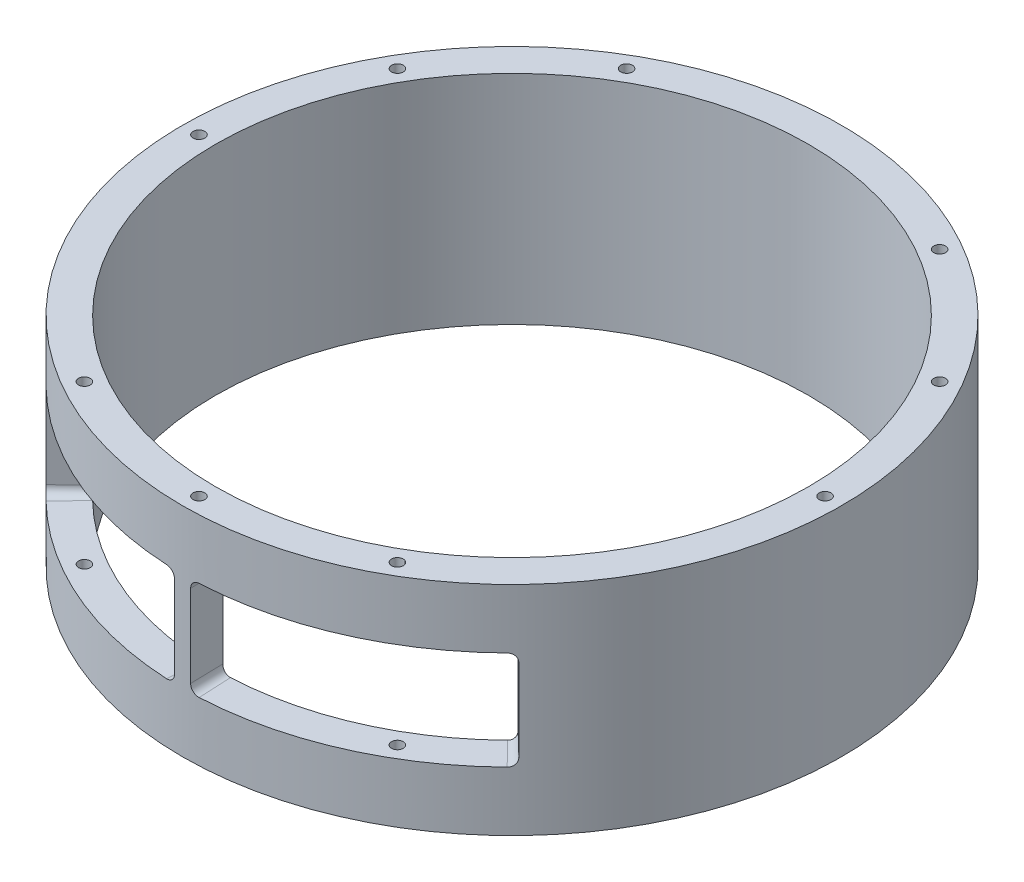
ISO-10303-21;
HEADER;
FILE_DESCRIPTION(('STEP AP214'),'2;1');
FILE_NAME('part.step','',(''),(''),'','','');
FILE_SCHEMA(('AUTOMOTIVE_DESIGN { 1 0 10303 214 1 1 1 1 }'));
ENDSEC;
DATA;
#1=APPLICATION_CONTEXT('core data for automotive mechanical design processes');
#2=APPLICATION_PROTOCOL_DEFINITION('international standard','automotive_design',2000,#1);
#3=PRODUCT_CONTEXT('',#1,'mechanical');
#4=PRODUCT('Part','Part','',(#3));
#5=PRODUCT_RELATED_PRODUCT_CATEGORY('part','',(#4));
#6=PRODUCT_DEFINITION_FORMATION('','',#4);
#7=PRODUCT_DEFINITION_CONTEXT('part definition',#1,'design');
#8=PRODUCT_DEFINITION('design','',#6,#7);
#9=PRODUCT_DEFINITION_SHAPE('','',#8);
#10=(LENGTH_UNIT() NAMED_UNIT(*) SI_UNIT(.MILLI.,.METRE.));
#11=(NAMED_UNIT(*) PLANE_ANGLE_UNIT() SI_UNIT($,.RADIAN.));
#12=(NAMED_UNIT(*) SI_UNIT($,.STERADIAN.) SOLID_ANGLE_UNIT());
#13=UNCERTAINTY_MEASURE_WITH_UNIT(LENGTH_MEASURE(1.E-05),#10,'distance_accuracy_value','');
#14=(GEOMETRIC_REPRESENTATION_CONTEXT(3) GLOBAL_UNCERTAINTY_ASSIGNED_CONTEXT((#13)) GLOBAL_UNIT_ASSIGNED_CONTEXT((#10,
#11,#12)) REPRESENTATION_CONTEXT('',''));
#15=CARTESIAN_POINT('',(0.,0.,0.));
#16=DIRECTION('',(0.,0.,1.));
#17=DIRECTION('',(1.,0.,0.));
#18=AXIS2_PLACEMENT_3D('',#15,#16,#17);
#19=CARTESIAN_POINT('',(-30.1625000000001,0.,52.2429824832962));
#20=DIRECTION('',(0.,1.,0.));
#21=DIRECTION('',(0.,0.,1.));
#22=AXIS2_PLACEMENT_3D('',#19,#20,#21);
#23=CYLINDRICAL_SURFACE('',#22,1.1303);
#24=CARTESIAN_POINT('',(-30.1625000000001,30.48,52.2429824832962));
#25=DIRECTION('',(0.,1.,0.));
#26=DIRECTION('',(0.,0.,1.));
#27=AXIS2_PLACEMENT_3D('',#24,#25,#26);
#28=CIRCLE('',#27,1.1303);
#29=CARTESIAN_POINT('',(-30.1625000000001,30.48,53.3732824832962));
#30=VERTEX_POINT('',#29);
#31=EDGE_CURVE('E593',#30,#30,#28,.F.);
#32=ORIENTED_EDGE('',*,*,#31,.T.);
#33=EDGE_LOOP('',(#32));
#34=FACE_BOUND('',#33,.T.);
#35=CARTESIAN_POINT('',(-30.1625000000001,41.91,52.2429824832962));
#36=DIRECTION('',(0.,1.,0.));
#37=DIRECTION('',(0.,0.,1.));
#38=AXIS2_PLACEMENT_3D('',#35,#36,#37);
#39=CIRCLE('',#38,1.1303);
#40=CARTESIAN_POINT('',(-30.1625000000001,41.91,53.3732824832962));
#41=VERTEX_POINT('',#40);
#42=EDGE_CURVE('E552',#41,#41,#39,.T.);
#43=ORIENTED_EDGE('',*,*,#42,.T.);
#44=EDGE_LOOP('',(#43));
#45=FACE_BOUND('',#44,.T.);
#46=ADVANCED_FACE('F95',(#34,#45),#23,.F.);
#47=CARTESIAN_POINT('',(30.1625000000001,0.,52.2429824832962));
#48=DIRECTION('',(0.,1.,0.));
#49=DIRECTION('',(0.,0.,1.));
#50=AXIS2_PLACEMENT_3D('',#47,#48,#49);
#51=CYLINDRICAL_SURFACE('',#50,1.1303);
#52=CARTESIAN_POINT('',(30.1625000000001,11.43,52.2429824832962));
#53=DIRECTION('',(0.,1.,0.));
#54=DIRECTION('',(0.,0.,1.));
#55=AXIS2_PLACEMENT_3D('',#52,#53,#54);
#56=CIRCLE('',#55,1.1303);
#57=CARTESIAN_POINT('',(30.1625000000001,11.43,53.3732824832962));
#58=VERTEX_POINT('',#57);
#59=EDGE_CURVE('E438',#58,#58,#56,.T.);
#60=ORIENTED_EDGE('',*,*,#59,.T.);
#61=EDGE_LOOP('',(#60));
#62=FACE_BOUND('',#61,.T.);
#63=CARTESIAN_POINT('',(30.1625000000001,0.,52.2429824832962));
#64=DIRECTION('',(0.,1.,0.));
#65=DIRECTION('',(0.,0.,1.));
#66=AXIS2_PLACEMENT_3D('',#63,#64,#65);
#67=CIRCLE('',#66,1.1303);
#68=CARTESIAN_POINT('',(30.1625000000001,0.,53.3732824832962));
#69=VERTEX_POINT('',#68);
#70=EDGE_CURVE('E555',#69,#69,#67,.T.);
#71=ORIENTED_EDGE('',*,*,#70,.F.);
#72=EDGE_LOOP('',(#71));
#73=FACE_BOUND('',#72,.T.);
#74=ADVANCED_FACE('F790',(#62,#73),#51,.F.);
#75=CARTESIAN_POINT('',(0.,41.91,0.));
#76=DIRECTION('',(0.,1.,0.));
#77=DIRECTION('',(0.,0.,1.));
#78=AXIS2_PLACEMENT_3D('',#75,#76,#77);
#79=PLANE('',#78);
#80=CARTESIAN_POINT('',(0.,41.91,60.325));
#81=DIRECTION('',(0.,1.,0.));
#82=DIRECTION('',(0.,0.,1.));
#83=AXIS2_PLACEMENT_3D('',#80,#81,#82);
#84=CIRCLE('',#83,1.1303);
#85=CARTESIAN_POINT('',(0.,41.91,61.4553));
#86=VERTEX_POINT('',#85);
#87=EDGE_CURVE('E520',#86,#86,#84,.T.);
#88=ORIENTED_EDGE('',*,*,#87,.F.);
#89=EDGE_LOOP('',(#88));
#90=FACE_BOUND('',#89,.T.);
#91=CARTESIAN_POINT('',(-60.325,41.91,-1.94289029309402E-13));
#92=DIRECTION('',(0.,1.,0.));
#93=DIRECTION('',(0.,0.,1.));
#94=AXIS2_PLACEMENT_3D('',#91,#92,#93);
#95=CIRCLE('',#94,1.1303);
#96=CARTESIAN_POINT('',(-60.325,41.91,1.13029999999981));
#97=VERTEX_POINT('',#96);
#98=EDGE_CURVE('E542',#97,#97,#95,.T.);
#99=ORIENTED_EDGE('',*,*,#98,.F.);
#100=EDGE_LOOP('',(#99));
#101=FACE_BOUND('',#100,.T.);
#102=CARTESIAN_POINT('',(52.2429824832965,41.91,-30.1624999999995));
#103=DIRECTION('',(0.,1.,0.));
#104=DIRECTION('',(0.,0.,1.));
#105=AXIS2_PLACEMENT_3D('',#102,#103,#104);
#106=CIRCLE('',#105,1.1303);
#107=CARTESIAN_POINT('',(52.2429824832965,41.91,-29.0321999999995));
#108=VERTEX_POINT('',#107);
#109=EDGE_CURVE('E527',#108,#108,#106,.T.);
#110=ORIENTED_EDGE('',*,*,#109,.F.);
#111=EDGE_LOOP('',(#110));
#112=FACE_BOUND('',#111,.T.);
#113=CARTESIAN_POINT('',(60.325,41.91,6.21031004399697E-13));
#114=DIRECTION('',(0.,1.,0.));
#115=DIRECTION('',(0.,0.,1.));
#116=AXIS2_PLACEMENT_3D('',#113,#114,#115);
#117=CIRCLE('',#116,1.1303);
#118=CARTESIAN_POINT('',(60.325,41.91,1.13030000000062));
#119=VERTEX_POINT('',#118);
#120=EDGE_CURVE('E528',#119,#119,#117,.T.);
#121=ORIENTED_EDGE('',*,*,#120,.F.);
#122=EDGE_LOOP('',(#121));
#123=FACE_BOUND('',#122,.T.);
#124=CARTESIAN_POINT('',(30.1625000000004,41.91,-52.242982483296));
#125=DIRECTION('',(0.,1.,0.));
#126=DIRECTION('',(0.,0.,1.));
#127=AXIS2_PLACEMENT_3D('',#124,#125,#126);
#128=CIRCLE('',#127,1.1303);
#129=CARTESIAN_POINT('',(30.1625000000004,41.91,-51.112682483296));
#130=VERTEX_POINT('',#129);
#131=EDGE_CURVE('E534',#130,#130,#128,.T.);
#132=ORIENTED_EDGE('',*,*,#131,.F.);
#133=EDGE_LOOP('',(#132));
#134=FACE_BOUND('',#133,.T.);
#135=CARTESIAN_POINT('',(-30.1624999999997,41.91,-52.2429824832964));
#136=DIRECTION('',(0.,1.,0.));
#137=DIRECTION('',(0.,0.,1.));
#138=AXIS2_PLACEMENT_3D('',#135,#136,#137);
#139=CIRCLE('',#138,1.1303);
#140=CARTESIAN_POINT('',(-30.1624999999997,41.91,-51.1126824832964));
#141=VERTEX_POINT('',#140);
#142=EDGE_CURVE('E541',#141,#141,#139,.T.);
#143=ORIENTED_EDGE('',*,*,#142,.F.);
#144=EDGE_LOOP('',(#143));
#145=FACE_BOUND('',#144,.T.);
#146=CARTESIAN_POINT('',(-52.2429824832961,41.91,-30.1625000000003));
#147=DIRECTION('',(0.,1.,0.));
#148=DIRECTION('',(0.,0.,1.));
#149=AXIS2_PLACEMENT_3D('',#146,#147,#148);
#150=CIRCLE('',#149,1.1303);
#151=CARTESIAN_POINT('',(-52.2429824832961,41.91,-29.0322000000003));
#152=VERTEX_POINT('',#151);
#153=EDGE_CURVE('E564',#152,#152,#150,.T.);
#154=ORIENTED_EDGE('',*,*,#153,.F.);
#155=EDGE_LOOP('',(#154));
#156=FACE_BOUND('',#155,.T.);
#157=CARTESIAN_POINT('',(30.1625000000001,41.91,52.2429824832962));
#158=DIRECTION('',(0.,1.,0.));
#159=DIRECTION('',(0.,0.,1.));
#160=AXIS2_PLACEMENT_3D('',#157,#158,#159);
#161=CIRCLE('',#160,1.1303);
#162=CARTESIAN_POINT('',(30.1625000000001,41.91,53.3732824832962));
#163=VERTEX_POINT('',#162);
#164=EDGE_CURVE('E558',#163,#163,#161,.T.);
#165=ORIENTED_EDGE('',*,*,#164,.F.);
#166=EDGE_LOOP('',(#165));
#167=FACE_BOUND('',#166,.T.);
#168=ORIENTED_EDGE('',*,*,#42,.F.);
#169=EDGE_LOOP('',(#168));
#170=FACE_BOUND('',#169,.T.);
#171=CARTESIAN_POINT('',(0.,41.91,0.));
#172=DIRECTION('',(0.,1.,0.));
#173=DIRECTION('',(0.,0.,1.));
#174=AXIS2_PLACEMENT_3D('',#171,#172,#173);
#175=CIRCLE('',#174,63.5);
#176=CARTESIAN_POINT('',(0.,41.91,63.5));
#177=VERTEX_POINT('',#176);
#178=EDGE_CURVE('E578',#177,#177,#175,.T.);
#179=ORIENTED_EDGE('',*,*,#178,.T.);
#180=EDGE_LOOP('',(#179));
#181=FACE_BOUND('',#180,.T.);
#182=CARTESIAN_POINT('',(0.,41.91,0.));
#183=DIRECTION('',(0.,1.,0.));
#184=DIRECTION('',(0.,0.,1.));
#185=AXIS2_PLACEMENT_3D('',#182,#183,#184);
#186=CIRCLE('',#185,57.15);
#187=CARTESIAN_POINT('',(0.,41.91,57.15));
#188=VERTEX_POINT('',#187);
#189=EDGE_CURVE('E572',#188,#188,#186,.T.);
#190=ORIENTED_EDGE('',*,*,#189,.F.);
#191=EDGE_LOOP('',(#190));
#192=FACE_BOUND('',#191,.T.);
#193=ADVANCED_FACE('F804',(#90,#101,#112,#123,#134,#145,#156,#167,#170,#181,#192),#79,.T.);
#194=CARTESIAN_POINT('',(0.,0.,0.));
#195=DIRECTION('',(0.,1.,0.));
#196=DIRECTION('',(0.,0.,1.));
#197=AXIS2_PLACEMENT_3D('',#194,#195,#196);
#198=PLANE('',#197);
#199=CARTESIAN_POINT('',(0.,0.,60.325));
#200=DIRECTION('',(0.,1.,0.));
#201=DIRECTION('',(0.,0.,1.));
#202=AXIS2_PLACEMENT_3D('',#199,#200,#201);
#203=CIRCLE('',#202,1.1303);
#204=CARTESIAN_POINT('',(0.,0.,61.4553));
#205=VERTEX_POINT('',#204);
#206=EDGE_CURVE('E516',#205,#205,#203,.T.);
#207=ORIENTED_EDGE('',*,*,#206,.T.);
#208=EDGE_LOOP('',(#207));
#209=FACE_BOUND('',#208,.T.);
#210=CARTESIAN_POINT('',(-60.325,0.,-1.94289029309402E-13));
#211=DIRECTION('',(0.,1.,0.));
#212=DIRECTION('',(0.,0.,1.));
#213=AXIS2_PLACEMENT_3D('',#210,#211,#212);
#214=CIRCLE('',#213,1.1303);
#215=CARTESIAN_POINT('',(-60.325,0.,1.13029999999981));
#216=VERTEX_POINT('',#215);
#217=EDGE_CURVE('E538',#216,#216,#214,.T.);
#218=ORIENTED_EDGE('',*,*,#217,.T.);
#219=EDGE_LOOP('',(#218));
#220=FACE_BOUND('',#219,.T.);
#221=CARTESIAN_POINT('',(52.2429824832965,0.,-30.1624999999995));
#222=DIRECTION('',(0.,1.,0.));
#223=DIRECTION('',(0.,0.,1.));
#224=AXIS2_PLACEMENT_3D('',#221,#222,#223);
#225=CIRCLE('',#224,1.1303);
#226=CARTESIAN_POINT('',(52.2429824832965,0.,-29.0321999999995));
#227=VERTEX_POINT('',#226);
#228=EDGE_CURVE('E545',#227,#227,#225,.T.);
#229=ORIENTED_EDGE('',*,*,#228,.T.);
#230=EDGE_LOOP('',(#229));
#231=FACE_BOUND('',#230,.T.);
#232=CARTESIAN_POINT('',(60.325,0.,6.21031004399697E-13));
#233=DIRECTION('',(0.,1.,0.));
#234=DIRECTION('',(0.,0.,1.));
#235=AXIS2_PLACEMENT_3D('',#232,#233,#234);
#236=CIRCLE('',#235,1.1303);
#237=CARTESIAN_POINT('',(60.325,0.,1.13030000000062));
#238=VERTEX_POINT('',#237);
#239=EDGE_CURVE('E524',#238,#238,#236,.T.);
#240=ORIENTED_EDGE('',*,*,#239,.T.);
#241=EDGE_LOOP('',(#240));
#242=FACE_BOUND('',#241,.T.);
#243=CARTESIAN_POINT('',(30.1625000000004,0.,-52.242982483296));
#244=DIRECTION('',(0.,1.,0.));
#245=DIRECTION('',(0.,0.,1.));
#246=AXIS2_PLACEMENT_3D('',#243,#244,#245);
#247=CIRCLE('',#246,1.1303);
#248=CARTESIAN_POINT('',(30.1625000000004,0.,-51.112682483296));
#249=VERTEX_POINT('',#248);
#250=EDGE_CURVE('E531',#249,#249,#247,.T.);
#251=ORIENTED_EDGE('',*,*,#250,.T.);
#252=EDGE_LOOP('',(#251));
#253=FACE_BOUND('',#252,.T.);
#254=CARTESIAN_POINT('',(-30.1624999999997,0.,-52.2429824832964));
#255=DIRECTION('',(0.,1.,0.));
#256=DIRECTION('',(0.,0.,1.));
#257=AXIS2_PLACEMENT_3D('',#254,#255,#256);
#258=CIRCLE('',#257,1.1303);
#259=CARTESIAN_POINT('',(-30.1624999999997,0.,-51.1126824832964));
#260=VERTEX_POINT('',#259);
#261=EDGE_CURVE('E567',#260,#260,#258,.T.);
#262=ORIENTED_EDGE('',*,*,#261,.T.);
#263=EDGE_LOOP('',(#262));
#264=FACE_BOUND('',#263,.T.);
#265=CARTESIAN_POINT('',(-52.2429824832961,0.,-30.1625000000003));
#266=DIRECTION('',(0.,1.,0.));
#267=DIRECTION('',(0.,0.,1.));
#268=AXIS2_PLACEMENT_3D('',#265,#266,#267);
#269=CIRCLE('',#268,1.1303);
#270=CARTESIAN_POINT('',(-52.2429824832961,0.,-29.0322000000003));
#271=VERTEX_POINT('',#270);
#272=EDGE_CURVE('E561',#271,#271,#269,.T.);
#273=ORIENTED_EDGE('',*,*,#272,.T.);
#274=EDGE_LOOP('',(#273));
#275=FACE_BOUND('',#274,.T.);
#276=ORIENTED_EDGE('',*,*,#70,.T.);
#277=EDGE_LOOP('',(#276));
#278=FACE_BOUND('',#277,.T.);
#279=CARTESIAN_POINT('',(-30.1625000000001,0.,52.2429824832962));
#280=DIRECTION('',(0.,1.,0.));
#281=DIRECTION('',(0.,0.,1.));
#282=AXIS2_PLACEMENT_3D('',#279,#280,#281);
#283=CIRCLE('',#282,1.1303);
#284=CARTESIAN_POINT('',(-30.1625000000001,0.,53.3732824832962));
#285=VERTEX_POINT('',#284);
#286=EDGE_CURVE('E523',#285,#285,#283,.T.);
#287=ORIENTED_EDGE('',*,*,#286,.T.);
#288=EDGE_LOOP('',(#287));
#289=FACE_BOUND('',#288,.T.);
#290=CARTESIAN_POINT('',(0.,0.,0.));
#291=DIRECTION('',(0.,1.,0.));
#292=DIRECTION('',(0.,0.,1.));
#293=AXIS2_PLACEMENT_3D('',#290,#291,#292);
#294=CIRCLE('',#293,63.5);
#295=CARTESIAN_POINT('',(0.,0.,63.5));
#296=VERTEX_POINT('',#295);
#297=EDGE_CURVE('E575',#296,#296,#294,.T.);
#298=ORIENTED_EDGE('',*,*,#297,.F.);
#299=EDGE_LOOP('',(#298));
#300=FACE_BOUND('',#299,.T.);
#301=CARTESIAN_POINT('',(0.,0.,0.));
#302=DIRECTION('',(0.,1.,0.));
#303=DIRECTION('',(0.,0.,1.));
#304=AXIS2_PLACEMENT_3D('',#301,#302,#303);
#305=CIRCLE('',#304,57.15);
#306=CARTESIAN_POINT('',(0.,0.,57.15));
#307=VERTEX_POINT('',#306);
#308=EDGE_CURVE('E519',#307,#307,#305,.T.);
#309=ORIENTED_EDGE('',*,*,#308,.T.);
#310=EDGE_LOOP('',(#309));
#311=FACE_BOUND('',#310,.T.);
#312=ADVANCED_FACE('F812',(#209,#220,#231,#242,#253,#264,#275,#278,#289,#300,#311),#198,.F.);
#313=CARTESIAN_POINT('',(0.,41.91,0.));
#314=DIRECTION('',(0.,-1.,0.));
#315=DIRECTION('',(0.,0.,-1.));
#316=AXIS2_PLACEMENT_3D('',#313,#314,#315);
#317=CYLINDRICAL_SURFACE('',#316,63.5);
#318=CARTESIAN_POINT('',(0.,11.43,0.));
#319=DIRECTION('',(0.,-1.,0.));
#320=DIRECTION('',(0.0493799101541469,0.,0.998780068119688));
#321=AXIS2_PLACEMENT_3D('',#318,#319,#320);
#322=CIRCLE('',#321,63.5);
#323=CARTESIAN_POINT('',(44.4319707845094,11.43,45.3657356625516));
#324=VERTEX_POINT('',#323);
#325=CARTESIAN_POINT('',(3.13562429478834,11.43,63.4225343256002));
#326=VERTEX_POINT('',#325);
#327=EDGE_CURVE('E243',#324,#326,#322,.T.);
#328=ORIENTED_EDGE('',*,*,#327,.T.);
#329=CARTESIAN_POINT('',(1.54924626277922,13.0175,63.4810982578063));
#330=CARTESIAN_POINT('',(1.55001118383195,12.5967267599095,63.4810795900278));
#331=CARTESIAN_POINT('',(1.71652242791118,12.1926442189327,63.4774932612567));
#332=CARTESIAN_POINT('',(2.3115378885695,11.5972917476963,63.4586116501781));
#333=CARTESIAN_POINT('',(2.71589046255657,11.4302970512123,63.4432860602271));
#334=CARTESIAN_POINT('',(3.13562429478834,11.43,63.4225343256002));
#335=B_SPLINE_CURVE_WITH_KNOTS('',3,(#329,#330,#331,#332,#333,#334),.UNSPECIFIED.,.F.,.F.,(4,2,
4),(0.,0.5,1.),.UNSPECIFIED.);
#336=CARTESIAN_POINT('',(1.54924626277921,13.0175,63.4810982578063));
#337=VERTEX_POINT('',#336);
#338=EDGE_CURVE('E221',#337,#326,#335,.T.);
#339=ORIENTED_EDGE('',*,*,#338,.F.);
#340=DIRECTION('',(0.,-1.,0.));
#341=VECTOR('',#340,1.);
#342=CARTESIAN_POINT('',(1.54924626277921,28.8925,63.4810982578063));
#343=LINE('',#342,#341);
#344=CARTESIAN_POINT('',(1.54924626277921,28.8925,63.4810982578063));
#345=VERTEX_POINT('',#344);
#346=EDGE_CURVE('E233',#345,#337,#343,.T.);
#347=ORIENTED_EDGE('',*,*,#346,.F.);
#348=CARTESIAN_POINT('',(3.13562429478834,30.48,63.4225343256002));
#349=CARTESIAN_POINT('',(2.71535458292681,30.4792348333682,63.4433125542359));
#350=CARTESIAN_POINT('',(2.31153212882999,30.312664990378,63.4586118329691));
#351=CARTESIAN_POINT('',(1.71652818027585,29.7173990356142,63.4774930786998));
#352=CARTESIAN_POINT('',(1.54954322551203,29.3127464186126,63.4810910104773));
#353=CARTESIAN_POINT('',(1.54924626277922,28.8925,63.4810982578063));
#354=B_SPLINE_CURVE_WITH_KNOTS('',3,(#348,#349,#350,#351,#352,#353),.UNSPECIFIED.,.F.,.F.,(4,2,
4),(0.,0.5,1.),.UNSPECIFIED.);
#355=CARTESIAN_POINT('',(3.13562429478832,30.48,63.4225343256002));
#356=VERTEX_POINT('',#355);
#357=EDGE_CURVE('E114',#356,#345,#354,.T.);
#358=ORIENTED_EDGE('',*,*,#357,.F.);
#359=CARTESIAN_POINT('',(0.,30.48,0.));
#360=DIRECTION('',(0.,-1.,0.));
#361=DIRECTION('',(0.0493799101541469,0.,0.998780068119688));
#362=AXIS2_PLACEMENT_3D('',#359,#360,#361);
#363=CIRCLE('',#362,63.5);
#364=CARTESIAN_POINT('',(44.4319707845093,30.48,45.3657356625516));
#365=VERTEX_POINT('',#364);
#366=EDGE_CURVE('E1251',#365,#356,#363,.T.);
#367=ORIENTED_EDGE('',*,*,#366,.F.);
#368=CARTESIAN_POINT('',(45.5521117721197,28.8925,44.2408760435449));
#369=CARTESIAN_POINT('',(45.5515786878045,29.313273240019,44.24142492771));
#370=CARTESIAN_POINT('',(45.4358850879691,29.7173557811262,44.36123246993));
#371=CARTESIAN_POINT('',(45.018009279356,30.3127082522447,44.7852368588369));
#372=CARTESIAN_POINT('',(44.7322037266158,30.4797029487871,45.0716824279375));
#373=CARTESIAN_POINT('',(44.4319707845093,30.48,45.3657356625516));
#374=B_SPLINE_CURVE_WITH_KNOTS('',3,(#368,#369,#370,#371,#372,#373),.UNSPECIFIED.,.F.,.F.,(4,2,
4),(0.,0.5,1.),.UNSPECIFIED.);
#375=CARTESIAN_POINT('',(45.5521117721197,28.8925,44.2408760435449));
#376=VERTEX_POINT('',#375);
#377=EDGE_CURVE('E270',#376,#365,#374,.T.);
#378=ORIENTED_EDGE('',*,*,#377,.F.);
#379=DIRECTION('',(0.,1.,0.));
#380=VECTOR('',#379,1.);
#381=CARTESIAN_POINT('',(45.5521117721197,13.0175,44.2408760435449));
#382=LINE('',#381,#380);
#383=CARTESIAN_POINT('',(45.5521117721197,13.0175,44.2408760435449));
#384=VERTEX_POINT('',#383);
#385=EDGE_CURVE('E1245',#384,#376,#382,.T.);
#386=ORIENTED_EDGE('',*,*,#385,.F.);
#387=CARTESIAN_POINT('',(44.4319707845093,11.43,45.3657356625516));
#388=CARTESIAN_POINT('',(44.7325870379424,11.4307651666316,45.0713070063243));
#389=CARTESIAN_POINT('',(45.0180133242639,11.5973350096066,44.7852327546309));
#390=CARTESIAN_POINT('',(45.4358810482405,12.1926009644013,44.3612365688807));
#391=CARTESIAN_POINT('',(45.5519048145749,12.597253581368,44.2410891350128));
#392=CARTESIAN_POINT('',(45.5521117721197,13.0175,44.2408760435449));
#393=B_SPLINE_CURVE_WITH_KNOTS('',3,(#387,#388,#389,#390,#391,#392),.UNSPECIFIED.,.F.,.F.,(4,2,
4),(0.,0.5,1.),.UNSPECIFIED.);
#394=EDGE_CURVE('E257',#324,#384,#393,.T.);
#395=ORIENTED_EDGE('',*,*,#394,.F.);
#396=EDGE_LOOP('',(#328,#339,#347,#358,#367,#378,#386,#395));
#397=FACE_BOUND('',#396,.T.);
#398=DIRECTION('',(0.,1.,0.));
#399=VECTOR('',#398,1.);
#400=CARTESIAN_POINT('',(-1.54924626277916,13.0175,63.4810982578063));
#401=LINE('',#400,#399);
#402=CARTESIAN_POINT('',(-1.54924626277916,13.0175,63.4810982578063));
#403=VERTEX_POINT('',#402);
#404=CARTESIAN_POINT('',(-1.54924626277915,28.8925,63.4810982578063));
#405=VERTEX_POINT('',#404);
#406=EDGE_CURVE('E1151',#403,#405,#401,.T.);
#407=ORIENTED_EDGE('',*,*,#406,.F.);
#408=CARTESIAN_POINT('',(-3.13562429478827,11.43,63.4225343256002));
#409=CARTESIAN_POINT('',(-2.71535458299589,11.4307651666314,63.4433125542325));
#410=CARTESIAN_POINT('',(-2.31153212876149,11.5973350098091,63.4586118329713));
#411=CARTESIAN_POINT('',(-1.71652818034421,12.1926009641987,63.4774930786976));
#412=CARTESIAN_POINT('',(-1.5495432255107,12.5972535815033,63.4810910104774));
#413=CARTESIAN_POINT('',(-1.54924626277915,13.0175,63.4810982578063));
#414=B_SPLINE_CURVE_WITH_KNOTS('',3,(#408,#409,#410,#411,#412,#413),.UNSPECIFIED.,.F.,.F.,(4,2,
4),(0.,0.5,1.),.UNSPECIFIED.);
#415=CARTESIAN_POINT('',(-3.13562429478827,11.43,63.4225343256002));
#416=VERTEX_POINT('',#415);
#417=EDGE_CURVE('E293',#416,#403,#414,.T.);
#418=ORIENTED_EDGE('',*,*,#417,.F.);
#419=CARTESIAN_POINT('',(0.,11.43,0.));
#420=DIRECTION('',(0.,-1.,0.));
#421=DIRECTION('',(-0.699716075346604,0.,0.714421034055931));
#422=AXIS2_PLACEMENT_3D('',#419,#420,#421);
#423=CIRCLE('',#422,63.5);
#424=CARTESIAN_POINT('',(-44.4319707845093,11.43,45.3657356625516));
#425=VERTEX_POINT('',#424);
#426=EDGE_CURVE('E1152',#416,#425,#423,.T.);
#427=ORIENTED_EDGE('',*,*,#426,.T.);
#428=CARTESIAN_POINT('',(-45.5521117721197,13.0175,44.240876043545));
#429=CARTESIAN_POINT('',(-45.5515786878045,12.5967267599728,44.2414249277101));
#430=CARTESIAN_POINT('',(-45.4358850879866,12.1926442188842,44.3612324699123));
#431=CARTESIAN_POINT('',(-45.0180092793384,11.5972917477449,44.7852368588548));
#432=CARTESIAN_POINT('',(-44.7322037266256,11.4302970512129,45.0716824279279));
#433=CARTESIAN_POINT('',(-44.4319707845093,11.43,45.3657356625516));
#434=B_SPLINE_CURVE_WITH_KNOTS('',3,(#428,#429,#430,#431,#432,#433),.UNSPECIFIED.,.F.,.F.,(4,2,
4),(0.,0.5,1.),.UNSPECIFIED.);
#435=CARTESIAN_POINT('',(-45.5521117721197,13.0175,44.240876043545));
#436=VERTEX_POINT('',#435);
#437=EDGE_CURVE('E123',#436,#425,#434,.T.);
#438=ORIENTED_EDGE('',*,*,#437,.F.);
#439=DIRECTION('',(0.,-1.,0.));
#440=VECTOR('',#439,1.);
#441=CARTESIAN_POINT('',(-45.5521117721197,28.8925,44.240876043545));
#442=LINE('',#441,#440);
#443=CARTESIAN_POINT('',(-45.5521117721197,28.8925,44.240876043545));
#444=VERTEX_POINT('',#443);
#445=EDGE_CURVE('E1165',#444,#436,#442,.T.);
#446=ORIENTED_EDGE('',*,*,#445,.F.);
#447=CARTESIAN_POINT('',(-44.4319707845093,30.48,45.3657356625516));
#448=CARTESIAN_POINT('',(-44.7325870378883,30.4792348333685,45.0713070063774));
#449=CARTESIAN_POINT('',(-45.0180133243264,30.3126649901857,44.7852327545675));
#450=CARTESIAN_POINT('',(-45.435881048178,29.7173990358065,44.3612365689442));
#451=CARTESIAN_POINT('',(-45.5519048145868,29.3127464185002,44.2410891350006));
#452=CARTESIAN_POINT('',(-45.5521117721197,28.8925,44.240876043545));
#453=B_SPLINE_CURVE_WITH_KNOTS('',3,(#447,#448,#449,#450,#451,#452),.UNSPECIFIED.,.F.,.F.,(4,2,
4),(0.,0.5,1.),.UNSPECIFIED.);
#454=CARTESIAN_POINT('',(-44.4319707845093,30.48,45.3657356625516));
#455=VERTEX_POINT('',#454);
#456=EDGE_CURVE('E319',#455,#444,#453,.T.);
#457=ORIENTED_EDGE('',*,*,#456,.F.);
#458=CARTESIAN_POINT('',(0.,30.48,0.));
#459=DIRECTION('',(0.,-1.,0.));
#460=DIRECTION('',(-0.699716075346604,0.,0.714421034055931));
#461=AXIS2_PLACEMENT_3D('',#458,#459,#460);
#462=CIRCLE('',#461,63.5);
#463=CARTESIAN_POINT('',(-3.13562429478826,30.48,63.4225343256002));
#464=VERTEX_POINT('',#463);
#465=EDGE_CURVE('E1158',#464,#455,#462,.T.);
#466=ORIENTED_EDGE('',*,*,#465,.F.);
#467=CARTESIAN_POINT('',(-1.54924626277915,28.8925,63.4810982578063));
#468=CARTESIAN_POINT('',(-1.55001118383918,29.3132732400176,63.4810795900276));
#469=CARTESIAN_POINT('',(-1.71652242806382,29.7173557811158,63.4774932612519));
#470=CARTESIAN_POINT('',(-2.31153788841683,30.312708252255,63.4586116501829));
#471=CARTESIAN_POINT('',(-2.71589046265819,30.4797029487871,63.4432860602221));
#472=CARTESIAN_POINT('',(-3.13562429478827,30.48,63.4225343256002));
#473=B_SPLINE_CURVE_WITH_KNOTS('',3,(#467,#468,#469,#470,#471,#472),.UNSPECIFIED.,.F.,.F.,(4,2,
4),(0.,0.5,1.),.UNSPECIFIED.);
#474=EDGE_CURVE('E306',#405,#464,#473,.T.);
#475=ORIENTED_EDGE('',*,*,#474,.F.);
#476=EDGE_LOOP('',(#407,#418,#427,#438,#446,#457,#466,#475));
#477=FACE_BOUND('',#476,.T.);
#478=ORIENTED_EDGE('',*,*,#178,.F.);
#479=EDGE_LOOP('',(#478));
#480=FACE_BOUND('',#479,.T.);
#481=ORIENTED_EDGE('',*,*,#297,.T.);
#482=EDGE_LOOP('',(#481));
#483=FACE_BOUND('',#482,.T.);
#484=ADVANCED_FACE('F97',(#397,#477,#480,#483),#317,.T.);
#485=CARTESIAN_POINT('',(0.,41.91,0.));
#486=DIRECTION('',(0.,-1.,0.));
#487=DIRECTION('',(0.,0.,-1.));
#488=AXIS2_PLACEMENT_3D('',#485,#486,#487);
#489=CYLINDRICAL_SURFACE('',#488,57.15);
#490=CARTESIAN_POINT('',(2.82206186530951,11.43,57.0802808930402));
#491=CARTESIAN_POINT('',(2.78492373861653,11.4300268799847,57.0821172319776));
#492=CARTESIAN_POINT('',(2.74780397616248,11.4316708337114,57.0839158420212));
#493=CARTESIAN_POINT('',(2.67385187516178,11.4381553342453,57.087427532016));
#494=CARTESIAN_POINT('',(2.63701945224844,11.442994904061,57.0891406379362));
#495=CARTESIAN_POINT('',(2.5275923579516,11.4622000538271,57.0941247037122));
#496=CARTESIAN_POINT('',(2.45576201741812,11.481252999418,57.0972554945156));
#497=CARTESIAN_POINT('',(2.31635040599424,11.5310052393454,57.103081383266));
#498=CARTESIAN_POINT('',(2.24876667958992,11.5616977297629,57.1057767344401));
#499=CARTESIAN_POINT('',(2.11935449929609,11.6335351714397,57.1107260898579));
#500=CARTESIAN_POINT('',(2.05752931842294,11.6746860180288,57.1129798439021));
#501=CARTESIAN_POINT('',(1.93836432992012,11.7680510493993,57.1171512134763));
#502=CARTESIAN_POINT('',(1.88134790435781,11.8206770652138,57.1190493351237));
#503=CARTESIAN_POINT('',(1.7760372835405,11.9340990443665,57.1224209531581));
#504=CARTESIAN_POINT('',(1.72774873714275,11.9949002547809,57.123894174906));
#505=CARTESIAN_POINT('',(1.66046024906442,12.0937216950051,57.1258779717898));
#506=CARTESIAN_POINT('',(1.6381291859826,12.1295237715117,57.1265216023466));
#507=CARTESIAN_POINT('',(1.59634428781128,12.2027245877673,57.1277044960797));
#508=CARTESIAN_POINT('',(1.57688774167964,12.2401217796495,57.1282438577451));
#509=CARTESIAN_POINT('',(1.52284070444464,12.3544569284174,57.1297187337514));
#510=CARTESIAN_POINT('',(1.49259882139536,12.4334998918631,57.1305102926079));
#511=CARTESIAN_POINT('',(1.44379986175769,12.595858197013,57.131765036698));
#512=CARTESIAN_POINT('',(1.42535359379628,12.6792063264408,57.1322251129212));
#513=CARTESIAN_POINT('',(1.40068874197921,12.8475383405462,57.1328329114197));
#514=CARTESIAN_POINT('',(1.39444729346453,12.9325188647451,57.1329812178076));
#515=CARTESIAN_POINT('',(1.3943216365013,13.0175,57.1329884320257));
#516=B_SPLINE_CURVE_WITH_KNOTS('',3,(#490,#491,#492,#493,#494,#495,#496,#497,#498,#499,#500,
#501,#502,#503,#504,#505,#506,#507,#508,#509,#510,#511,#512,#513,#514,#515),.UNSPECIFIED.,.F.,
.F.,(4,2,2,2,2,2,2,2,2,2,2,2,4),(0.,0.111478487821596,0.222922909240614,0.444905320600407,
0.666758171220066,0.888736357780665,1.12062263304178,1.35265845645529,1.47914558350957,
1.60551264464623,1.85838484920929,2.11359894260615,2.36833445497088),.UNSPECIFIED.);
#517=CARTESIAN_POINT('',(2.8220618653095,11.43,57.0802808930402));
#518=VERTEX_POINT('',#517);
#519=CARTESIAN_POINT('',(1.39432163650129,13.0175,57.1329884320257));
#520=VERTEX_POINT('',#519);
#521=EDGE_CURVE('E13',#518,#520,#516,.T.);
#522=ORIENTED_EDGE('',*,*,#521,.F.);
#523=CARTESIAN_POINT('',(0.,11.43,0.));
#524=DIRECTION('',(0.,1.,0.));
#525=DIRECTION('',(0.,0.,1.));
#526=AXIS2_PLACEMENT_3D('',#523,#524,#525);
#527=CIRCLE('',#526,57.15);
#528=CARTESIAN_POINT('',(39.9887737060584,11.43,40.8291620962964));
#529=VERTEX_POINT('',#528);
#530=EDGE_CURVE('E588',#529,#518,#527,.F.);
#531=ORIENTED_EDGE('',*,*,#530,.F.);
#532=CARTESIAN_POINT('',(40.9969005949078,13.0175,39.8167884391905));
#533=CARTESIAN_POINT('',(40.9968713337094,12.9613403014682,39.8168177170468));
#534=CARTESIAN_POINT('',(40.9949821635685,12.905220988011,39.8187638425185));
#535=CARTESIAN_POINT('',(40.9874774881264,12.793472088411,39.8264890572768));
#536=CARTESIAN_POINT('',(40.9818602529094,12.7378427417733,39.8322699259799));
#537=CARTESIAN_POINT('',(40.9593816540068,12.5721784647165,39.8553892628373));
#538=CARTESIAN_POINT('',(40.9368934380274,12.4635780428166,39.8785043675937));
#539=CARTESIAN_POINT('',(40.8810686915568,12.2684490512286,39.9357243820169));
#540=CARTESIAN_POINT('',(40.8494958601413,12.1808769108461,39.9680370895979));
#541=CARTESIAN_POINT('',(40.7755775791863,12.0155860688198,40.0434457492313));
#542=CARTESIAN_POINT('',(40.733255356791,11.937846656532,40.0865184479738));
#543=CARTESIAN_POINT('',(40.6424671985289,11.8013722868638,40.1785537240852));
#544=CARTESIAN_POINT('',(40.5947800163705,11.7416063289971,40.2267532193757));
#545=CARTESIAN_POINT('',(40.4920502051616,11.6359218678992,40.3301581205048));
#546=CARTESIAN_POINT('',(40.4370071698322,11.5900041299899,40.3853639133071));
#547=CARTESIAN_POINT('',(40.3275485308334,11.5185355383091,40.4946497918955));
#548=CARTESIAN_POINT('',(40.2736959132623,11.4913312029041,40.5482183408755));
#549=CARTESIAN_POINT('',(40.1632156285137,11.4512853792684,40.6576512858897));
#550=CARTESIAN_POINT('',(40.1065960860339,11.4384042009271,40.7135088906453));
#551=CARTESIAN_POINT('',(40.0394844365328,11.4320109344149,40.7794358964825));
#552=CARTESIAN_POINT('',(40.0293481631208,11.4312816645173,40.7893857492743));
#553=CARTESIAN_POINT('',(40.0090683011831,11.4302913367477,40.809277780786));
#554=CARTESIAN_POINT('',(39.9989247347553,11.4300297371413,40.819219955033));
#555=CARTESIAN_POINT('',(39.9887737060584,11.43,40.8291620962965));
#556=B_SPLINE_CURVE_WITH_KNOTS('',3,(#532,#533,#534,#535,#536,#537,#538,#539,#540,#541,#542,
#543,#544,#545,#546,#547,#548,#549,#550,#551,#552,#553,#554,#555),.UNSPECIFIED.,.F.,.F.,(4,2,2,
2,2,2,2,2,2,2,2,4),(0.,0.168337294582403,0.336752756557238,0.674205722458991,0.968329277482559,
1.26182262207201,1.53146548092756,1.80112323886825,2.04192922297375,2.28206624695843,
2.3247305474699,2.3673453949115),.UNSPECIFIED.);
#557=CARTESIAN_POINT('',(40.9969005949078,13.0175,39.8167884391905));
#558=VERTEX_POINT('',#557);
#559=EDGE_CURVE('E106',#558,#529,#556,.T.);
#560=ORIENTED_EDGE('',*,*,#559,.F.);
#561=DIRECTION('',(0.,-1.,0.));
#562=VECTOR('',#561,1.);
#563=CARTESIAN_POINT('',(40.9969005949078,41.91,39.8167884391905));
#564=LINE('',#563,#562);
#565=CARTESIAN_POINT('',(40.9969005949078,28.8925,39.8167884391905));
#566=VERTEX_POINT('',#565);
#567=EDGE_CURVE('E1212',#566,#558,#564,.T.);
#568=ORIENTED_EDGE('',*,*,#567,.F.);
#569=CARTESIAN_POINT('',(39.9887737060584,30.48,40.8291620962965));
#570=CARTESIAN_POINT('',(40.0153385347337,30.4799731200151,40.8031443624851));
#571=CARTESIAN_POINT('',(40.0418631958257,30.4783291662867,40.7771144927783));
#572=CARTESIAN_POINT('',(40.0946545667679,30.4718446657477,40.7252076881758));
#573=CARTESIAN_POINT('',(40.1209213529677,30.4670050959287,40.6993307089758));
#574=CARTESIAN_POINT('',(40.1988810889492,30.4477999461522,40.6223800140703));
#575=CARTESIAN_POINT('',(40.2499521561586,30.4287470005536,40.5717722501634));
#576=CARTESIAN_POINT('',(40.3488893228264,30.3789947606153,40.4733803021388));
#577=CARTESIAN_POINT('',(40.3967572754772,30.3483022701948,40.4255944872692));
#578=CARTESIAN_POINT('',(40.4882613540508,30.2764648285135,40.3339483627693));
#579=CARTESIAN_POINT('',(40.5318950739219,30.2353139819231,40.2900902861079));
#580=CARTESIAN_POINT('',(40.6158701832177,30.1419489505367,40.2054387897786));
#581=CARTESIAN_POINT('',(40.6559776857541,30.0893229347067,40.1648695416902));
#582=CARTESIAN_POINT('',(40.7299585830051,29.9759009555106,40.0898460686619));
#583=CARTESIAN_POINT('',(40.7638279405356,29.9150997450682,40.055395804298));
#584=CARTESIAN_POINT('',(40.8109730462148,29.8162783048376,40.0073435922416));
#585=CARTESIAN_POINT('',(40.8266082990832,29.7804762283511,39.9913864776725));
#586=CARTESIAN_POINT('',(40.8558485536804,29.7072754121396,39.9615136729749));
#587=CARTESIAN_POINT('',(40.869455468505,29.6698782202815,39.9475960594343));
#588=CARTESIAN_POINT('',(40.907236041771,29.5555430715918,39.9089193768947));
#589=CARTESIAN_POINT('',(40.9283513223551,29.4765001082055,39.8872550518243));
#590=CARTESIAN_POINT('',(40.9624068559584,29.3141418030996,39.852281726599));
#591=CARTESIAN_POINT('',(40.9752695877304,29.2307936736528,39.8390519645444));
#592=CARTESIAN_POINT('',(40.9924631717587,29.0624616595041,39.8213571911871));
#593=CARTESIAN_POINT('',(40.9968099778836,28.9774811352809,39.8168757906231));
#594=CARTESIAN_POINT('',(40.9969005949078,28.8925,39.8167884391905));
#595=B_SPLINE_CURVE_WITH_KNOTS('',3,(#569,#570,#571,#572,#573,#574,#575,#576,#577,#578,#579,
#580,#581,#582,#583,#584,#585,#586,#587,#588,#589,#590,#591,#592,#593,#594),.UNSPECIFIED.,.F.,
.F.,(4,2,2,2,2,2,2,2,2,2,2,2,4),(0.,0.111478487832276,0.222922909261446,0.444905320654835,
0.666758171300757,0.888736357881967,1.12062263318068,1.35265845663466,1.47914558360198,
1.60551264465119,1.85838484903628,2.11359894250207,2.36833445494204),.UNSPECIFIED.);
#596=CARTESIAN_POINT('',(39.9887737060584,30.48,40.8291620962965));
#597=VERTEX_POINT('',#596);
#598=EDGE_CURVE('E1205',#597,#566,#595,.T.);
#599=ORIENTED_EDGE('',*,*,#598,.F.);
#600=CARTESIAN_POINT('',(0.,30.48,0.));
#601=DIRECTION('',(0.,1.,0.));
#602=DIRECTION('',(0.,0.,1.));
#603=AXIS2_PLACEMENT_3D('',#600,#601,#602);
#604=CIRCLE('',#603,57.15);
#605=CARTESIAN_POINT('',(2.8220618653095,30.48,57.0802808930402));
#606=VERTEX_POINT('',#605);
#607=EDGE_CURVE('E436',#606,#597,#604,.T.);
#608=ORIENTED_EDGE('',*,*,#607,.F.);
#609=CARTESIAN_POINT('',(1.3943216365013,28.8925,57.1329884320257));
#610=CARTESIAN_POINT('',(1.39436299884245,28.9486596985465,57.1329868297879));
#611=CARTESIAN_POINT('',(1.39707447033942,29.0047790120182,57.1329213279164));
#612=CARTESIAN_POINT('',(1.40784151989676,29.116527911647,57.1326572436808));
#613=CARTESIAN_POINT('',(1.41589957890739,29.1721572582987,57.1324585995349));
#614=CARTESIAN_POINT('',(1.44813533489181,29.3378215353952,57.1316541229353));
#615=CARTESIAN_POINT('',(1.48037451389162,29.4464219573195,57.1308397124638));
#616=CARTESIAN_POINT('',(1.56028691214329,29.6415509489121,57.128708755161));
#617=CARTESIAN_POINT('',(1.60544685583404,29.7291230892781,57.1274701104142));
#618=CARTESIAN_POINT('',(1.71099774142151,29.8944139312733,57.1244060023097));
#619=CARTESIAN_POINT('',(1.77135584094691,29.9721533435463,57.1225818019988));
#620=CARTESIAN_POINT('',(1.90056760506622,30.108627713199,57.1184222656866));
#621=CARTESIAN_POINT('',(1.96833228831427,30.1683936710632,57.116140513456));
#622=CARTESIAN_POINT('',(2.11399930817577,30.2740781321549,57.1109340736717));
#623=CARTESIAN_POINT('',(2.19190220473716,30.3199958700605,57.1080093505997));
#624=CARTESIAN_POINT('',(2.3464555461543,30.3914644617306,57.1018561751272));
#625=CARTESIAN_POINT('',(2.42234818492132,30.4186687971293,57.098693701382));
#626=CARTESIAN_POINT('',(2.57770318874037,30.4587146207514,57.0918903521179));
#627=CARTESIAN_POINT('',(2.65715505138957,30.4715957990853,57.0882508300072));
#628=CARTESIAN_POINT('',(2.75112338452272,30.4779890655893,57.0837457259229));
#629=CARTESIAN_POINT('',(2.76531047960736,30.4787183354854,57.0830602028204));
#630=CARTESIAN_POINT('',(2.79368400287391,30.4797086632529,57.0816785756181));
#631=CARTESIAN_POINT('',(2.80787041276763,30.4799702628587,57.080982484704));
#632=CARTESIAN_POINT('',(2.8220618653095,30.48,57.0802808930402));
#633=B_SPLINE_CURVE_WITH_KNOTS('',3,(#609,#610,#611,#612,#613,#614,#615,#616,#617,#618,#619,
#620,#621,#622,#623,#624,#625,#626,#627,#628,#629,#630,#631,#632),.UNSPECIFIED.,.F.,.F.,(4,2,2,
2,2,2,2,2,2,2,2,4),(0.,0.168337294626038,0.33675275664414,0.674205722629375,0.968329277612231,
1.26182262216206,1.53146548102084,1.8011232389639,2.041929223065,2.28206624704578,
2.32473054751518,2.36734539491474),.UNSPECIFIED.);
#634=CARTESIAN_POINT('',(1.39432163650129,28.8925,57.1329884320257));
#635=VERTEX_POINT('',#634);
#636=EDGE_CURVE('E1192',#635,#606,#633,.T.);
#637=ORIENTED_EDGE('',*,*,#636,.F.);
#638=DIRECTION('',(0.,-1.,0.));
#639=VECTOR('',#638,1.);
#640=CARTESIAN_POINT('',(1.39432163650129,41.91,57.1329884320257));
#641=LINE('',#640,#639);
#642=EDGE_CURVE('E1190',#520,#635,#641,.F.);
#643=ORIENTED_EDGE('',*,*,#642,.F.);
#644=EDGE_LOOP('',(#522,#531,#560,#568,#599,#608,#637,#643));
#645=FACE_BOUND('',#644,.T.);
#646=CARTESIAN_POINT('',(-1.39432163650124,13.0175,57.1329884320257));
#647=CARTESIAN_POINT('',(-1.39436299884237,12.9613403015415,57.1329868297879));
#648=CARTESIAN_POINT('',(-1.39707447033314,12.9052209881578,57.1329213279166));
#649=CARTESIAN_POINT('',(-1.40784151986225,12.7934720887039,57.1326572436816));
#650=CARTESIAN_POINT('',(-1.41589957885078,12.7378427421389,57.1324585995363));
#651=CARTESIAN_POINT('',(-1.44813533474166,12.5721784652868,57.1316541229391));
#652=CARTESIAN_POINT('',(-1.48037451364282,12.463578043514,57.1308397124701));
#653=CARTESIAN_POINT('',(-1.56028691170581,12.2684490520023,57.1287087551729));
#654=CARTESIAN_POINT('',(-1.60544685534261,12.1808769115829,57.127470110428));
#655=CARTESIAN_POINT('',(-1.71099774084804,12.0155860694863,57.1244060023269));
#656=CARTESIAN_POINT('',(-1.7713558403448,11.9378466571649,57.1225818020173));
#657=CARTESIAN_POINT('',(-1.90056760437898,11.8013722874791,57.1184222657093));
#658=CARTESIAN_POINT('',(-1.96833228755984,11.7416063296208,57.1161405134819));
#659=CARTESIAN_POINT('',(-2.11399930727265,11.6359218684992,57.1109340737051));
#660=CARTESIAN_POINT('',(-2.19190220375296,11.5900041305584,57.1080093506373));
#661=CARTESIAN_POINT('',(-2.34645554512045,11.5185355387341,57.1018561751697));
#662=CARTESIAN_POINT('',(-2.42234818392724,11.4913312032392,57.0986937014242));
#663=CARTESIAN_POINT('',(-2.57770318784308,11.4512853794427,57.0918903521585));
#664=CARTESIAN_POINT('',(-2.65715505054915,11.4384042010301,57.0882508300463));
#665=CARTESIAN_POINT('',(-2.75112338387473,11.4320109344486,57.0837457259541));
#666=CARTESIAN_POINT('',(-2.76531047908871,11.4312816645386,57.0830602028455));
#667=CARTESIAN_POINT('',(-2.79368400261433,11.4302913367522,57.0816785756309));
#668=CARTESIAN_POINT('',(-2.80787041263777,11.4300297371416,57.0809824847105));
#669=CARTESIAN_POINT('',(-2.82206186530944,11.43,57.0802808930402));
#670=B_SPLINE_CURVE_WITH_KNOTS('',3,(#646,#647,#648,#649,#650,#651,#652,#653,#654,#655,#656,
#657,#658,#659,#660,#661,#662,#663,#664,#665,#666,#667,#668,#669),.UNSPECIFIED.,.F.,.F.,(4,2,2,
2,2,2,2,2,2,2,2,4),(0.,0.168337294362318,0.3367527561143,0.674205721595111,0.968329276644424,
1.26182262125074,1.5314654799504,1.80112323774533,2.04192922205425,2.28206624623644,
2.32473054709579,2.36734539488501),.UNSPECIFIED.);
#671=CARTESIAN_POINT('',(-1.39432163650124,13.0175,57.1329884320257));
#672=VERTEX_POINT('',#671);
#673=CARTESIAN_POINT('',(-2.82206186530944,11.43,57.0802808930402));
#674=VERTEX_POINT('',#673);
#675=EDGE_CURVE('E1188',#672,#674,#670,.T.);
#676=ORIENTED_EDGE('',*,*,#675,.F.);
#677=DIRECTION('',(0.,-1.,0.));
#678=VECTOR('',#677,1.);
#679=CARTESIAN_POINT('',(-1.39432163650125,41.91,57.1329884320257));
#680=LINE('',#679,#678);
#681=CARTESIAN_POINT('',(-1.39432163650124,28.8925,57.1329884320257));
#682=VERTEX_POINT('',#681);
#683=EDGE_CURVE('E1084',#682,#672,#680,.T.);
#684=ORIENTED_EDGE('',*,*,#683,.F.);
#685=CARTESIAN_POINT('',(-2.82206186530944,30.48,57.0802808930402));
#686=CARTESIAN_POINT('',(-2.78492373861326,30.4799731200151,57.0821172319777));
#687=CARTESIAN_POINT('',(-2.74780397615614,30.478329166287,57.0839158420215));
#688=CARTESIAN_POINT('',(-2.67385187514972,30.4718446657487,57.0874275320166));
#689=CARTESIAN_POINT('',(-2.63701945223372,30.4670050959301,57.0891406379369));
#690=CARTESIAN_POINT('',(-2.52759235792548,30.447799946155,57.0941247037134));
#691=CARTESIAN_POINT('',(-2.45576201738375,30.4287470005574,57.0972554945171));
#692=CARTESIAN_POINT('',(-2.31635040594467,30.3789947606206,57.103081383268));
#693=CARTESIAN_POINT('',(-2.24876667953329,30.3483022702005,57.1057767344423));
#694=CARTESIAN_POINT('',(-2.11935449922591,30.2764648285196,57.1107260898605));
#695=CARTESIAN_POINT('',(-2.05752931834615,30.2353139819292,57.1129798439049));
#696=CARTESIAN_POINT('',(-1.93836432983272,30.141948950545,57.1171512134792));
#697=CARTESIAN_POINT('',(-1.8813479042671,30.0893229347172,57.1190493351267));
#698=CARTESIAN_POINT('',(-1.77603728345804,29.9759009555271,57.1224209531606));
#699=CARTESIAN_POINT('',(-1.72774873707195,29.9150997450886,57.1238941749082));
#700=CARTESIAN_POINT('',(-1.66046024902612,29.8162783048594,57.125877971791));
#701=CARTESIAN_POINT('',(-1.63812918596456,29.7804762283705,57.1265216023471));
#702=CARTESIAN_POINT('',(-1.59634428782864,29.7072754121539,57.1277044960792));
#703=CARTESIAN_POINT('',(-1.57688774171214,29.6698782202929,57.1282438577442));
#704=CARTESIAN_POINT('',(-1.52284070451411,29.555543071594,57.1297187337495));
#705=CARTESIAN_POINT('',(-1.49259882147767,29.4765001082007,57.1305102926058));
#706=CARTESIAN_POINT('',(-1.44379986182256,29.3141418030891,57.1317650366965));
#707=CARTESIAN_POINT('',(-1.42535359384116,29.230793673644,57.1322251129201));
#708=CARTESIAN_POINT('',(-1.40068874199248,29.0624616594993,57.1328329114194));
#709=CARTESIAN_POINT('',(-1.3944472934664,28.9774811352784,57.1329812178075));
#710=CARTESIAN_POINT('',(-1.39432163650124,28.8925,57.1329884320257));
#711=B_SPLINE_CURVE_WITH_KNOTS('',3,(#685,#686,#687,#688,#689,#690,#691,#692,#693,#694,#695,
#696,#697,#698,#699,#700,#701,#702,#703,#704,#705,#706,#707,#708,#709,#710),.UNSPECIFIED.,.F.,
.F.,(4,2,2,2,2,2,2,2,2,2,2,2,4),(0.,0.111478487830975,0.222922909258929,0.44490532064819,
0.666758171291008,0.888736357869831,1.12062263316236,1.35265845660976,1.47914558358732,
1.60551264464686,1.85838484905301,2.11359894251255,2.36833445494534),.UNSPECIFIED.);
#712=CARTESIAN_POINT('',(-2.82206186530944,30.48,57.0802808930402));
#713=VERTEX_POINT('',#712);
#714=EDGE_CURVE('E1082',#713,#682,#711,.T.);
#715=ORIENTED_EDGE('',*,*,#714,.F.);
#716=CARTESIAN_POINT('',(0.,30.48,0.));
#717=DIRECTION('',(0.,1.,0.));
#718=DIRECTION('',(0.,0.,1.));
#719=AXIS2_PLACEMENT_3D('',#716,#717,#718);
#720=CIRCLE('',#719,57.15);
#721=CARTESIAN_POINT('',(-39.9887737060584,30.48,40.8291620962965));
#722=VERTEX_POINT('',#721);
#723=EDGE_CURVE('E537',#722,#713,#720,.T.);
#724=ORIENTED_EDGE('',*,*,#723,.F.);
#725=CARTESIAN_POINT('',(-40.9969005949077,28.8925,39.8167884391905));
#726=CARTESIAN_POINT('',(-40.9968713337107,28.9486596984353,39.8168177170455));
#727=CARTESIAN_POINT('',(-40.9949821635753,29.0047790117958,39.8187638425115));
#728=CARTESIAN_POINT('',(-40.9874774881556,29.1165279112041,39.8264890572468));
#729=CARTESIAN_POINT('',(-40.9818602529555,29.1721572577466,39.8322699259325));
#730=CARTESIAN_POINT('',(-40.9593816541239,29.3378215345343,39.8553892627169));
#731=CARTESIAN_POINT('',(-40.936893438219,29.4464219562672,39.8785043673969));
#732=CARTESIAN_POINT('',(-40.8810686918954,29.6415509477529,39.9357243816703));
#733=CARTESIAN_POINT('',(-40.8494958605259,29.7291230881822,39.9680370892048));
#734=CARTESIAN_POINT('',(-40.7755775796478,29.8944139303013,40.0434457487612));
#735=CARTESIAN_POINT('',(-40.7332553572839,29.9721533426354,40.086518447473));
#736=CARTESIAN_POINT('',(-40.642467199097,30.108627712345,40.1785537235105));
#737=CARTESIAN_POINT('',(-40.5947800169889,30.1683936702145,40.2267532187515));
#738=CARTESIAN_POINT('',(-40.4920502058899,30.2740781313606,40.3301581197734));
#739=CARTESIAN_POINT('',(-40.43700717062,30.3199958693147,40.3853639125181));
#740=CARTESIAN_POINT('',(-40.3275485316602,30.3914644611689,40.4946497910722));
#741=CARTESIAN_POINT('',(-40.2736959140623,30.4186687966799,40.548218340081));
#742=CARTESIAN_POINT('',(-40.1632156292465,30.4587146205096,40.6576512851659));
#743=CARTESIAN_POINT('',(-40.1065960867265,30.4715957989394,40.7135088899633));
#744=CARTESIAN_POINT('',(-40.0394844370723,30.477989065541,40.7794358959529));
#745=CARTESIAN_POINT('',(-40.0293481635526,30.4787183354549,40.7893857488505));
#746=CARTESIAN_POINT('',(-40.0090683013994,30.4797086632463,40.8092777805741));
#747=CARTESIAN_POINT('',(-39.9989247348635,30.4799702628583,40.819219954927));
#748=CARTESIAN_POINT('',(-39.9887737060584,30.48,40.8291620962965));
#749=B_SPLINE_CURVE_WITH_KNOTS('',3,(#725,#726,#727,#728,#729,#730,#731,#732,#733,#734,#735,
#736,#737,#738,#739,#740,#741,#742,#743,#744,#745,#746,#747,#748),.UNSPECIFIED.,.F.,.F.,(4,2,2,
2,2,2,2,2,2,2,2,4),(0.,0.168337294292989,0.336752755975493,0.674205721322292,0.968329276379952,
1.2618226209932,1.53146547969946,1.80112323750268,2.04192922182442,2.28206624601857,
2.32473054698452,2.36734539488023),.UNSPECIFIED.);
#750=CARTESIAN_POINT('',(-40.9969005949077,28.8925,39.8167884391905));
#751=VERTEX_POINT('',#750);
#752=EDGE_CURVE('E1075',#751,#722,#749,.T.);
#753=ORIENTED_EDGE('',*,*,#752,.F.);
#754=DIRECTION('',(0.,-1.,0.));
#755=VECTOR('',#754,1.);
#756=CARTESIAN_POINT('',(-40.9969005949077,41.91,39.8167884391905));
#757=LINE('',#756,#755);
#758=CARTESIAN_POINT('',(-40.9969005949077,13.0175,39.8167884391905));
#759=VERTEX_POINT('',#758);
#760=EDGE_CURVE('E597',#759,#751,#757,.F.);
#761=ORIENTED_EDGE('',*,*,#760,.F.);
#762=CARTESIAN_POINT('',(-39.9887737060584,11.43,40.8291620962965));
#763=CARTESIAN_POINT('',(-40.0153385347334,11.4300268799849,40.8031443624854));
#764=CARTESIAN_POINT('',(-40.041863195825,11.431670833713,40.777114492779));
#765=CARTESIAN_POINT('',(-40.0946545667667,11.4381553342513,40.725207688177));
#766=CARTESIAN_POINT('',(-40.1209213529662,11.4429949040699,40.6993307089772));
#767=CARTESIAN_POINT('',(-40.1988810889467,11.462200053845,40.6223800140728));
#768=CARTESIAN_POINT('',(-40.2499521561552,11.4812529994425,40.5717722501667));
#769=CARTESIAN_POINT('',(-40.3488893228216,11.5310052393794,40.4733803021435));
#770=CARTESIAN_POINT('',(-40.3967572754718,11.5616977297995,40.4255944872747));
#771=CARTESIAN_POINT('',(-40.488261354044,11.6335351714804,40.3339483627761));
#772=CARTESIAN_POINT('',(-40.5318950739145,11.6746860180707,40.2900902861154));
#773=CARTESIAN_POINT('',(-40.6158701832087,11.768051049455,40.2054387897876));
#774=CARTESIAN_POINT('',(-40.6559776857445,11.8206770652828,40.1648695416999));
#775=CARTESIAN_POINT('',(-40.7299585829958,11.9340990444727,40.0898460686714));
#776=CARTESIAN_POINT('',(-40.7638279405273,11.9949002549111,40.0553958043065));
#777=CARTESIAN_POINT('',(-40.8109730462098,12.0937216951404,40.0073435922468));
#778=CARTESIAN_POINT('',(-40.8266082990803,12.1295237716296,39.9913864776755));
#779=CARTESIAN_POINT('',(-40.8558485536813,12.202724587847,39.961513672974));
#780=CARTESIAN_POINT('',(-40.8694554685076,12.2401217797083,39.9475960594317));
#781=CARTESIAN_POINT('',(-40.9072360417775,12.3544569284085,39.9089193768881));
#782=CARTESIAN_POINT('',(-40.928351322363,12.4334998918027,39.8872550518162));
#783=CARTESIAN_POINT('',(-40.9624068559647,12.5958581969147,39.8522817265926));
#784=CARTESIAN_POINT('',(-40.9752695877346,12.6792063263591,39.8390519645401));
#785=CARTESIAN_POINT('',(-40.9924631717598,12.8475383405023,39.821357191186));
#786=CARTESIAN_POINT('',(-40.9968099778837,12.9325188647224,39.816875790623));
#787=CARTESIAN_POINT('',(-40.9969005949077,13.0175,39.8167884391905));
#788=B_SPLINE_CURVE_WITH_KNOTS('',3,(#762,#763,#764,#765,#766,#767,#768,#769,#770,#771,#772,
#773,#774,#775,#776,#777,#778,#779,#780,#781,#782,#783,#784,#785,#786,#787),.UNSPECIFIED.,.F.,
.F.,(4,2,2,2,2,2,2,2,2,2,2,2,4),(0.,0.111478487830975,0.222922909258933,0.444905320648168,
0.666758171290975,0.888736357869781,1.12062263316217,1.35265845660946,1.47914558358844,
1.6055126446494,1.85838484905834,2.1135989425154,2.36833445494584),.UNSPECIFIED.);
#789=CARTESIAN_POINT('',(-39.9887737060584,11.43,40.8291620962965));
#790=VERTEX_POINT('',#789);
#791=EDGE_CURVE('E581',#790,#759,#788,.T.);
#792=ORIENTED_EDGE('',*,*,#791,.F.);
#793=CARTESIAN_POINT('',(0.,11.43,0.));
#794=DIRECTION('',(0.,1.,0.));
#795=DIRECTION('',(0.,0.,1.));
#796=AXIS2_PLACEMENT_3D('',#793,#794,#795);
#797=CIRCLE('',#796,57.15);
#798=EDGE_CURVE('E592',#674,#790,#797,.F.);
#799=ORIENTED_EDGE('',*,*,#798,.F.);
#800=EDGE_LOOP('',(#676,#684,#715,#724,#753,#761,#792,#799));
#801=FACE_BOUND('',#800,.T.);
#802=ORIENTED_EDGE('',*,*,#189,.T.);
#803=EDGE_LOOP('',(#802));
#804=FACE_BOUND('',#803,.T.);
#805=ORIENTED_EDGE('',*,*,#308,.F.);
#806=EDGE_LOOP('',(#805));
#807=FACE_BOUND('',#806,.T.);
#808=ADVANCED_FACE('F336',(#645,#801,#804,#807),#489,.F.);
#809=CARTESIAN_POINT('',(-30.1625000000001,11.43,52.2429824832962));
#810=DIRECTION('',(0.,1.,0.));
#811=DIRECTION('',(0.,0.,1.));
#812=AXIS2_PLACEMENT_3D('',#809,#810,#811);
#813=CIRCLE('',#812,1.1303);
#814=CARTESIAN_POINT('',(-30.1625000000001,11.43,53.3732824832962));
#815=VERTEX_POINT('',#814);
#816=EDGE_CURVE('E589',#815,#815,#813,.T.);
#817=ORIENTED_EDGE('',*,*,#816,.T.);
#818=EDGE_LOOP('',(#817));
#819=FACE_BOUND('',#818,.T.);
#820=ORIENTED_EDGE('',*,*,#286,.F.);
#821=EDGE_LOOP('',(#820));
#822=FACE_BOUND('',#821,.T.);
#823=ADVANCED_FACE('F781',(#819,#822),#23,.F.);
#824=CARTESIAN_POINT('',(30.1625000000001,30.48,52.2429824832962));
#825=DIRECTION('',(0.,1.,0.));
#826=DIRECTION('',(0.,0.,1.));
#827=AXIS2_PLACEMENT_3D('',#824,#825,#826);
#828=CIRCLE('',#827,1.1303);
#829=CARTESIAN_POINT('',(30.1625000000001,30.48,53.3732824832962));
#830=VERTEX_POINT('',#829);
#831=EDGE_CURVE('E228',#830,#830,#828,.F.);
#832=ORIENTED_EDGE('',*,*,#831,.T.);
#833=EDGE_LOOP('',(#832));
#834=FACE_BOUND('',#833,.T.);
#835=ORIENTED_EDGE('',*,*,#164,.T.);
#836=EDGE_LOOP('',(#835));
#837=FACE_BOUND('',#836,.T.);
#838=ADVANCED_FACE('F784',(#834,#837),#51,.F.);
#839=CARTESIAN_POINT('',(-52.2429824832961,0.,-30.1625000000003));
#840=DIRECTION('',(0.,1.,0.));
#841=DIRECTION('',(0.,0.,1.));
#842=AXIS2_PLACEMENT_3D('',#839,#840,#841);
#843=CYLINDRICAL_SURFACE('',#842,1.1303);
#844=ORIENTED_EDGE('',*,*,#272,.F.);
#845=EDGE_LOOP('',(#844));
#846=FACE_BOUND('',#845,.T.);
#847=ORIENTED_EDGE('',*,*,#153,.T.);
#848=EDGE_LOOP('',(#847));
#849=FACE_BOUND('',#848,.T.);
#850=ADVANCED_FACE('F788',(#846,#849),#843,.F.);
#851=CARTESIAN_POINT('',(-30.1624999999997,0.,-52.2429824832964));
#852=DIRECTION('',(0.,1.,0.));
#853=DIRECTION('',(0.,0.,1.));
#854=AXIS2_PLACEMENT_3D('',#851,#852,#853);
#855=CYLINDRICAL_SURFACE('',#854,1.1303);
#856=ORIENTED_EDGE('',*,*,#261,.F.);
#857=EDGE_LOOP('',(#856));
#858=FACE_BOUND('',#857,.T.);
#859=ORIENTED_EDGE('',*,*,#142,.T.);
#860=EDGE_LOOP('',(#859));
#861=FACE_BOUND('',#860,.T.);
#862=ADVANCED_FACE('F773',(#858,#861),#855,.F.);
#863=CARTESIAN_POINT('',(30.1625000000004,0.,-52.242982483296));
#864=DIRECTION('',(0.,1.,0.));
#865=DIRECTION('',(0.,0.,1.));
#866=AXIS2_PLACEMENT_3D('',#863,#864,#865);
#867=CYLINDRICAL_SURFACE('',#866,1.1303);
#868=ORIENTED_EDGE('',*,*,#250,.F.);
#869=EDGE_LOOP('',(#868));
#870=FACE_BOUND('',#869,.T.);
#871=ORIENTED_EDGE('',*,*,#131,.T.);
#872=EDGE_LOOP('',(#871));
#873=FACE_BOUND('',#872,.T.);
#874=ADVANCED_FACE('F769',(#870,#873),#867,.F.);
#875=CARTESIAN_POINT('',(60.325,0.,6.21031004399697E-13));
#876=DIRECTION('',(0.,1.,0.));
#877=DIRECTION('',(0.,0.,1.));
#878=AXIS2_PLACEMENT_3D('',#875,#876,#877);
#879=CYLINDRICAL_SURFACE('',#878,1.1303);
#880=ORIENTED_EDGE('',*,*,#239,.F.);
#881=EDGE_LOOP('',(#880));
#882=FACE_BOUND('',#881,.T.);
#883=ORIENTED_EDGE('',*,*,#120,.T.);
#884=EDGE_LOOP('',(#883));
#885=FACE_BOUND('',#884,.T.);
#886=ADVANCED_FACE('F765',(#882,#885),#879,.F.);
#887=CARTESIAN_POINT('',(52.2429824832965,0.,-30.1624999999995));
#888=DIRECTION('',(0.,1.,0.));
#889=DIRECTION('',(0.,0.,1.));
#890=AXIS2_PLACEMENT_3D('',#887,#888,#889);
#891=CYLINDRICAL_SURFACE('',#890,1.1303);
#892=ORIENTED_EDGE('',*,*,#228,.F.);
#893=EDGE_LOOP('',(#892));
#894=FACE_BOUND('',#893,.T.);
#895=ORIENTED_EDGE('',*,*,#109,.T.);
#896=EDGE_LOOP('',(#895));
#897=FACE_BOUND('',#896,.T.);
#898=ADVANCED_FACE('F768',(#894,#897),#891,.F.);
#899=CARTESIAN_POINT('',(-60.325,0.,-1.94289029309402E-13));
#900=DIRECTION('',(0.,1.,0.));
#901=DIRECTION('',(0.,0.,1.));
#902=AXIS2_PLACEMENT_3D('',#899,#900,#901);
#903=CYLINDRICAL_SURFACE('',#902,1.1303);
#904=ORIENTED_EDGE('',*,*,#217,.F.);
#905=EDGE_LOOP('',(#904));
#906=FACE_BOUND('',#905,.T.);
#907=ORIENTED_EDGE('',*,*,#98,.T.);
#908=EDGE_LOOP('',(#907));
#909=FACE_BOUND('',#908,.T.);
#910=ADVANCED_FACE('F763',(#906,#909),#903,.F.);
#911=CARTESIAN_POINT('',(0.,0.,60.325));
#912=DIRECTION('',(0.,1.,0.));
#913=DIRECTION('',(0.,0.,1.));
#914=AXIS2_PLACEMENT_3D('',#911,#912,#913);
#915=CYLINDRICAL_SURFACE('',#914,1.1303);
#916=ORIENTED_EDGE('',*,*,#206,.F.);
#917=EDGE_LOOP('',(#916));
#918=FACE_BOUND('',#917,.T.);
#919=ORIENTED_EDGE('',*,*,#87,.T.);
#920=EDGE_LOOP('',(#919));
#921=FACE_BOUND('',#920,.T.);
#922=ADVANCED_FACE('F759',(#918,#921),#915,.F.);
#923=CARTESIAN_POINT('',(0.,11.43,0.));
#924=DIRECTION('',(0.,1.,0.));
#925=DIRECTION('',(0.,0.,1.));
#926=AXIS2_PLACEMENT_3D('',#923,#924,#925);
#927=PLANE('',#926);
#928=ORIENTED_EDGE('',*,*,#530,.T.);
#929=CARTESIAN_POINT('',(3.13562429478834,11.43,63.4225343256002));
#930=CARTESIAN_POINT('',(2.69663689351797,11.43,54.5433795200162));
#931=B_SPLINE_CURVE_WITH_KNOTS('',1,(#929,#930),.UNSPECIFIED.,.F.,.F.,(2,2),(0.,1.),.UNSPECIFIED.);
#932=EDGE_CURVE('E229',#518,#326,#931,.F.);
#933=ORIENTED_EDGE('',*,*,#932,.T.);
#934=ORIENTED_EDGE('',*,*,#327,.F.);
#935=CARTESIAN_POINT('',(38.211494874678,11.43,39.0145326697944));
#936=CARTESIAN_POINT('',(44.4319707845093,11.43,45.3657356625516));
#937=B_SPLINE_CURVE_WITH_KNOTS('',1,(#935,#936),.UNSPECIFIED.,.F.,.F.,(2,2),(0.,1.),.UNSPECIFIED.);
#938=EDGE_CURVE('E454',#529,#324,#937,.T.);
#939=ORIENTED_EDGE('',*,*,#938,.F.);
#940=EDGE_LOOP('',(#928,#933,#934,#939));
#941=FACE_BOUND('',#940,.T.);
#942=ORIENTED_EDGE('',*,*,#59,.F.);
#943=EDGE_LOOP('',(#942));
#944=FACE_BOUND('',#943,.T.);
#945=ADVANCED_FACE('F348',(#941,#944),#927,.T.);
#946=CARTESIAN_POINT('',(0.,30.48,0.));
#947=DIRECTION('',(0.,1.,0.));
#948=DIRECTION('',(0.,0.,1.));
#949=AXIS2_PLACEMENT_3D('',#946,#947,#948);
#950=PLANE('',#949);
#951=ORIENTED_EDGE('',*,*,#607,.T.);
#952=CARTESIAN_POINT('',(44.4319707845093,30.48,45.3657356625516));
#953=CARTESIAN_POINT('',(38.211494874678,30.48,39.0145326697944));
#954=B_SPLINE_CURVE_WITH_KNOTS('',1,(#952,#953),.UNSPECIFIED.,.F.,.F.,(2,2),(0.,1.),.UNSPECIFIED.);
#955=EDGE_CURVE('E1264',#597,#365,#954,.F.);
#956=ORIENTED_EDGE('',*,*,#955,.T.);
#957=ORIENTED_EDGE('',*,*,#366,.T.);
#958=CARTESIAN_POINT('',(2.69663689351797,30.48,54.5433795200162));
#959=CARTESIAN_POINT('',(3.13562429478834,30.48,63.4225343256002));
#960=B_SPLINE_CURVE_WITH_KNOTS('',1,(#958,#959),.UNSPECIFIED.,.F.,.F.,(2,2),(0.,1.),.UNSPECIFIED.);
#961=EDGE_CURVE('E433',#606,#356,#960,.T.);
#962=ORIENTED_EDGE('',*,*,#961,.F.);
#963=EDGE_LOOP('',(#951,#956,#957,#962));
#964=FACE_BOUND('',#963,.T.);
#965=ORIENTED_EDGE('',*,*,#831,.F.);
#966=EDGE_LOOP('',(#965));
#967=FACE_BOUND('',#966,.T.);
#968=ADVANCED_FACE('F347',(#964,#967),#950,.F.);
#969=CARTESIAN_POINT('',(1.54924626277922,13.0175,63.4810982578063));
#970=CARTESIAN_POINT('',(1.55001118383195,12.5967267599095,63.4810795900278));
#971=CARTESIAN_POINT('',(1.71652242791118,12.1926442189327,63.4774932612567));
#972=CARTESIAN_POINT('',(2.3115378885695,11.5972917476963,63.4586116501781));
#973=CARTESIAN_POINT('',(2.71589046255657,11.4302970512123,63.4432860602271));
#974=CARTESIAN_POINT('',(3.13562429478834,11.43,63.4225343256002));
#975=CARTESIAN_POINT('',(1.33235178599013,13.0175,54.5937445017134));
#976=CARTESIAN_POINT('',(1.33300961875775,12.5967263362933,54.5937284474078));
#977=CARTESIAN_POINT('',(1.47620928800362,12.1926442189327,54.5906442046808));
#978=CARTESIAN_POINT('',(1.98792258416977,11.5972917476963,54.5744060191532));
#979=CARTESIAN_POINT('',(2.33566593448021,11.4302970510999,54.5612260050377));
#980=CARTESIAN_POINT('',(2.69663689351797,11.43,54.5433795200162));
#981=B_SPLINE_SURFACE_WITH_KNOTS('',1,3,((#969,#970,#971,#972,#973,#974),(#975,#976,#977,#978,
#979,#980)),.UNSPECIFIED.,.F.,.F.,.F.,(2,2),(4,2,4),(0.,1.),(0.,0.5,1.),.UNSPECIFIED.);
#982=CARTESIAN_POINT('',(1.33235178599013,13.0175,54.5937445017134));
#983=CARTESIAN_POINT('',(1.54924626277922,13.0175,63.4810982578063));
#984=B_SPLINE_CURVE_WITH_KNOTS('',1,(#982,#983),.UNSPECIFIED.,.F.,.F.,(2,2),(0.,1.),.UNSPECIFIED.);
#985=EDGE_CURVE('E215',#520,#337,#984,.T.);
#986=ORIENTED_EDGE('',*,*,#521,.T.);
#987=ORIENTED_EDGE('',*,*,#985,.T.);
#988=ORIENTED_EDGE('',*,*,#338,.T.);
#989=ORIENTED_EDGE('',*,*,#932,.F.);
#990=EDGE_LOOP('',(#986,#987,#988,#989));
#991=FACE_BOUND('',#990,.T.);
#992=ADVANCED_FACE('F218',(#991),#981,.F.);
#993=CARTESIAN_POINT('',(44.4319707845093,11.43,45.3657356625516));
#994=CARTESIAN_POINT('',(44.7325870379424,11.4307651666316,45.0713070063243));
#995=CARTESIAN_POINT('',(45.0180133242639,11.5973350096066,44.7852327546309));
#996=CARTESIAN_POINT('',(45.4358810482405,12.1926009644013,44.3612365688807));
#997=CARTESIAN_POINT('',(45.5519048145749,12.597253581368,44.2410891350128));
#998=CARTESIAN_POINT('',(45.5521117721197,13.0175,44.2408760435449));
#999=CARTESIAN_POINT('',(38.211494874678,11.43,39.0145326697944));
#1000=CARTESIAN_POINT('',(38.4700244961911,11.4307651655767,38.7613243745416));
#1001=CARTESIAN_POINT('',(38.7154914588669,11.5973350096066,38.5153001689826));
#1002=CARTESIAN_POINT('',(39.0748577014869,12.1926009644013,38.1506634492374));
#1003=CARTESIAN_POINT('',(39.1746381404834,12.5972534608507,38.0473366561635));
#1004=CARTESIAN_POINT('',(39.174816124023,13.0175,38.0471533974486));
#1005=B_SPLINE_SURFACE_WITH_KNOTS('',1,3,((#993,#994,#995,#996,#997,#998),(#999,#1000,#1001,
#1002,#1003,#1004)),.UNSPECIFIED.,.F.,.F.,.F.,(2,2),(4,2,4),(0.,1.),(0.,0.5,1.),.UNSPECIFIED.);
#1006=CARTESIAN_POINT('',(45.5521117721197,13.0175,44.2408760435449));
#1007=CARTESIAN_POINT('',(39.174816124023,13.0175,38.0471533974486));
#1008=B_SPLINE_CURVE_WITH_KNOTS('',1,(#1006,#1007),.UNSPECIFIED.,.F.,.F.,(2,2),(0.,1.),.UNSPECIFIED.);
#1009=EDGE_CURVE('E510',#558,#384,#1008,.F.);
#1010=ORIENTED_EDGE('',*,*,#559,.T.);
#1011=ORIENTED_EDGE('',*,*,#938,.T.);
#1012=ORIENTED_EDGE('',*,*,#394,.T.);
#1013=ORIENTED_EDGE('',*,*,#1009,.F.);
#1014=EDGE_LOOP('',(#1010,#1011,#1012,#1013));
#1015=FACE_BOUND('',#1014,.T.);
#1016=ADVANCED_FACE('F346',(#1015),#1005,.F.);
#1017=CARTESIAN_POINT('',(45.5521117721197,20.955,44.2408760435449));
#1018=DIRECTION('',(0.696706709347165,0.,-0.717356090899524));
#1019=DIRECTION('',(0.,1.,0.));
#1020=AXIS2_PLACEMENT_3D('',#1017,#1018,#1019);
#1021=PLANE('',#1020);
#1022=ORIENTED_EDGE('',*,*,#567,.T.);
#1023=ORIENTED_EDGE('',*,*,#1009,.T.);
#1024=ORIENTED_EDGE('',*,*,#385,.T.);
#1025=CARTESIAN_POINT('',(39.174816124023,28.8925,38.0471533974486));
#1026=CARTESIAN_POINT('',(45.5521117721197,28.8925,44.2408760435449));
#1027=B_SPLINE_CURVE_WITH_KNOTS('',1,(#1025,#1026),.UNSPECIFIED.,.F.,.F.,(2,2),(0.,1.),.UNSPECIFIED.);
#1028=EDGE_CURVE('E1265',#566,#376,#1027,.T.);
#1029=ORIENTED_EDGE('',*,*,#1028,.F.);
#1030=EDGE_LOOP('',(#1022,#1023,#1024,#1029));
#1031=FACE_BOUND('',#1030,.T.);
#1032=ADVANCED_FACE('F480',(#1031),#1021,.F.);
#1033=CARTESIAN_POINT('',(45.5521117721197,28.8925,44.2408760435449));
#1034=CARTESIAN_POINT('',(45.5515786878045,29.313273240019,44.24142492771));
#1035=CARTESIAN_POINT('',(45.4358850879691,29.7173557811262,44.36123246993));
#1036=CARTESIAN_POINT('',(45.018009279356,30.3127082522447,44.7852368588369));
#1037=CARTESIAN_POINT('',(44.7322037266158,30.4797029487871,45.0716824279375));
#1038=CARTESIAN_POINT('',(44.4319707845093,30.48,45.3657356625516));
#1039=CARTESIAN_POINT('',(39.174816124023,28.8925,38.0471533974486));
#1040=CARTESIAN_POINT('',(39.1743576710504,29.3132736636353,38.0476254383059));
#1041=CARTESIAN_POINT('',(39.0748611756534,29.7173557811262,38.1506599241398));
#1042=CARTESIAN_POINT('',(38.7154879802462,30.3127082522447,38.5153036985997));
#1043=CARTESIAN_POINT('',(38.4696951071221,30.4797029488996,38.7616469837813));
#1044=CARTESIAN_POINT('',(38.211494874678,30.48,39.0145326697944));
#1045=B_SPLINE_SURFACE_WITH_KNOTS('',1,3,((#1033,#1034,#1035,#1036,#1037,#1038),(#1039,#1040,
#1041,#1042,#1043,#1044)),.UNSPECIFIED.,.F.,.F.,.F.,(2,2),(4,2,4),(0.,1.),(0.,0.5,1.),.UNSPECIFIED.);
#1046=ORIENTED_EDGE('',*,*,#598,.T.);
#1047=ORIENTED_EDGE('',*,*,#1028,.T.);
#1048=ORIENTED_EDGE('',*,*,#377,.T.);
#1049=ORIENTED_EDGE('',*,*,#955,.F.);
#1050=EDGE_LOOP('',(#1046,#1047,#1048,#1049));
#1051=FACE_BOUND('',#1050,.T.);
#1052=ADVANCED_FACE('F399',(#1051),#1045,.F.);
#1053=CARTESIAN_POINT('',(3.13562429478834,30.48,63.4225343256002));
#1054=CARTESIAN_POINT('',(2.71535458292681,30.4792348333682,63.4433125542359));
#1055=CARTESIAN_POINT('',(2.31153212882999,30.312664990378,63.4586118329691));
#1056=CARTESIAN_POINT('',(1.71652818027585,29.7173990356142,63.4774930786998));
#1057=CARTESIAN_POINT('',(1.54954322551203,29.3127464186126,63.4810910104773));
#1058=CARTESIAN_POINT('',(1.54924626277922,28.8925,63.4810982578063));
#1059=CARTESIAN_POINT('',(2.69663689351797,30.48,54.5433795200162));
#1060=CARTESIAN_POINT('',(2.33520543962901,30.4792348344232,54.5612487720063));
#1061=CARTESIAN_POINT('',(1.98791763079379,30.312664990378,54.5744061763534));
#1062=CARTESIAN_POINT('',(1.47621423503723,29.7173990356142,54.5906440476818));
#1063=CARTESIAN_POINT('',(1.33260717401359,29.3127465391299,54.5937382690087));
#1064=CARTESIAN_POINT('',(1.33235178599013,28.8925,54.5937445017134));
#1065=B_SPLINE_SURFACE_WITH_KNOTS('',1,3,((#1053,#1054,#1055,#1056,#1057,#1058),(#1059,#1060,
#1061,#1062,#1063,#1064)),.UNSPECIFIED.,.F.,.F.,.F.,(2,2),(4,2,4),(0.,1.),(0.,0.5,1.),.UNSPECIFIED.);
#1066=CARTESIAN_POINT('',(1.54924626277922,28.8925,63.4810982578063));
#1067=CARTESIAN_POINT('',(1.33235178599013,28.8925,54.5937445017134));
#1068=B_SPLINE_CURVE_WITH_KNOTS('',1,(#1066,#1067),.UNSPECIFIED.,.F.,.F.,(2,2),(0.,1.),.UNSPECIFIED.);
#1069=EDGE_CURVE('E235',#635,#345,#1068,.F.);
#1070=ORIENTED_EDGE('',*,*,#636,.T.);
#1071=ORIENTED_EDGE('',*,*,#961,.T.);
#1072=ORIENTED_EDGE('',*,*,#357,.T.);
#1073=ORIENTED_EDGE('',*,*,#1069,.F.);
#1074=EDGE_LOOP('',(#1070,#1071,#1072,#1073));
#1075=FACE_BOUND('',#1074,.T.);
#1076=ADVANCED_FACE('F388',(#1075),#1065,.F.);
#1077=CARTESIAN_POINT('',(1.54924626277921,20.955,63.4810982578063));
#1078=DIRECTION('',(-0.999702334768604,0.,0.0243975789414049));
#1079=DIRECTION('',(0.,-1.,0.));
#1080=AXIS2_PLACEMENT_3D('',#1077,#1078,#1079);
#1081=PLANE('',#1080);
#1082=ORIENTED_EDGE('',*,*,#642,.T.);
#1083=ORIENTED_EDGE('',*,*,#1069,.T.);
#1084=ORIENTED_EDGE('',*,*,#346,.T.);
#1085=ORIENTED_EDGE('',*,*,#985,.F.);
#1086=EDGE_LOOP('',(#1082,#1083,#1084,#1085));
#1087=FACE_BOUND('',#1086,.T.);
#1088=ADVANCED_FACE('F234',(#1087),#1081,.F.);
#1089=CARTESIAN_POINT('',(0.,30.48,0.));
#1090=DIRECTION('',(0.,1.,0.));
#1091=DIRECTION('',(0.,0.,1.));
#1092=AXIS2_PLACEMENT_3D('',#1089,#1090,#1091);
#1093=PLANE('',#1092);
#1094=ORIENTED_EDGE('',*,*,#723,.T.);
#1095=CARTESIAN_POINT('',(-3.13562429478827,30.48,63.4225343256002));
#1096=CARTESIAN_POINT('',(-2.69663689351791,30.48,54.5433795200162));
#1097=B_SPLINE_CURVE_WITH_KNOTS('',1,(#1095,#1096),.UNSPECIFIED.,.F.,.F.,(2,2),(0.,1.),.UNSPECIFIED.);
#1098=EDGE_CURVE('E664',#713,#464,#1097,.F.);
#1099=ORIENTED_EDGE('',*,*,#1098,.T.);
#1100=ORIENTED_EDGE('',*,*,#465,.T.);
#1101=CARTESIAN_POINT('',(-38.211494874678,30.48,39.0145326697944));
#1102=CARTESIAN_POINT('',(-44.4319707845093,30.48,45.3657356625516));
#1103=B_SPLINE_CURVE_WITH_KNOTS('',1,(#1101,#1102),.UNSPECIFIED.,.F.,.F.,(2,2),(0.,1.),.UNSPECIFIED.);
#1104=EDGE_CURVE('E1079',#722,#455,#1103,.T.);
#1105=ORIENTED_EDGE('',*,*,#1104,.F.);
#1106=EDGE_LOOP('',(#1094,#1099,#1100,#1105));
#1107=FACE_BOUND('',#1106,.T.);
#1108=ORIENTED_EDGE('',*,*,#31,.F.);
#1109=EDGE_LOOP('',(#1108));
#1110=FACE_BOUND('',#1109,.T.);
#1111=ADVANCED_FACE('F692',(#1107,#1110),#1093,.F.);
#1112=CARTESIAN_POINT('',(0.,11.43,0.));
#1113=DIRECTION('',(0.,1.,0.));
#1114=DIRECTION('',(0.,0.,1.));
#1115=AXIS2_PLACEMENT_3D('',#1112,#1113,#1114);
#1116=PLANE('',#1115);
#1117=ORIENTED_EDGE('',*,*,#798,.T.);
#1118=CARTESIAN_POINT('',(-44.4319707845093,11.43,45.3657356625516));
#1119=CARTESIAN_POINT('',(-38.211494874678,11.43,39.0145326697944));
#1120=B_SPLINE_CURVE_WITH_KNOTS('',1,(#1118,#1119),.UNSPECIFIED.,.F.,.F.,(2,2),(0.,1.),.UNSPECIFIED.);
#1121=EDGE_CURVE('E651',#790,#425,#1120,.F.);
#1122=ORIENTED_EDGE('',*,*,#1121,.T.);
#1123=ORIENTED_EDGE('',*,*,#426,.F.);
#1124=CARTESIAN_POINT('',(-2.69663689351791,11.43,54.5433795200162));
#1125=CARTESIAN_POINT('',(-3.13562429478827,11.43,63.4225343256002));
#1126=B_SPLINE_CURVE_WITH_KNOTS('',1,(#1124,#1125),.UNSPECIFIED.,.F.,.F.,(2,2),(0.,1.),.UNSPECIFIED.);
#1127=EDGE_CURVE('E1149',#674,#416,#1126,.T.);
#1128=ORIENTED_EDGE('',*,*,#1127,.F.);
#1129=EDGE_LOOP('',(#1117,#1122,#1123,#1128));
#1130=FACE_BOUND('',#1129,.T.);
#1131=ORIENTED_EDGE('',*,*,#816,.F.);
#1132=EDGE_LOOP('',(#1131));
#1133=FACE_BOUND('',#1132,.T.);
#1134=ADVANCED_FACE('F746',(#1130,#1133),#1116,.T.);
#1135=CARTESIAN_POINT('',(-3.13562429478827,11.43,63.4225343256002));
#1136=CARTESIAN_POINT('',(-2.71535458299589,11.4307651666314,63.4433125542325));
#1137=CARTESIAN_POINT('',(-2.31153212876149,11.5973350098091,63.4586118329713));
#1138=CARTESIAN_POINT('',(-1.71652818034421,12.1926009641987,63.4774930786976));
#1139=CARTESIAN_POINT('',(-1.5495432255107,12.5972535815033,63.4810910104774));
#1140=CARTESIAN_POINT('',(-1.54924626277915,13.0175,63.4810982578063));
#1141=CARTESIAN_POINT('',(-2.69663689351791,11.43,54.5433795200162));
#1142=CARTESIAN_POINT('',(-2.3352054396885,11.4307651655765,54.5612487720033));
#1143=CARTESIAN_POINT('',(-1.98791763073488,11.5973350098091,54.5744061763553));
#1144=CARTESIAN_POINT('',(-1.47621423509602,12.1926009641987,54.5906440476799));
#1145=CARTESIAN_POINT('',(-1.33260717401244,12.597253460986,54.5937382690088));
#1146=CARTESIAN_POINT('',(-1.33235178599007,13.0175,54.5937445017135));
#1147=B_SPLINE_SURFACE_WITH_KNOTS('',1,3,((#1135,#1136,#1137,#1138,#1139,#1140),(#1141,#1142,
#1143,#1144,#1145,#1146)),.UNSPECIFIED.,.F.,.F.,.F.,(2,2),(4,2,4),(0.,1.),(0.,0.5,1.),.UNSPECIFIED.);
#1148=CARTESIAN_POINT('',(-1.54924626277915,13.0175,63.4810982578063));
#1149=CARTESIAN_POINT('',(-1.33235178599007,13.0175,54.5937445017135));
#1150=B_SPLINE_CURVE_WITH_KNOTS('',1,(#1148,#1149),.UNSPECIFIED.,.F.,.F.,(2,2),(0.,1.),.UNSPECIFIED.);
#1151=EDGE_CURVE('E734',#672,#403,#1150,.F.);
#1152=ORIENTED_EDGE('',*,*,#675,.T.);
#1153=ORIENTED_EDGE('',*,*,#1127,.T.);
#1154=ORIENTED_EDGE('',*,*,#417,.T.);
#1155=ORIENTED_EDGE('',*,*,#1151,.F.);
#1156=EDGE_LOOP('',(#1152,#1153,#1154,#1155));
#1157=FACE_BOUND('',#1156,.T.);
#1158=ADVANCED_FACE('F755',(#1157),#1147,.F.);
#1159=CARTESIAN_POINT('',(-1.54924626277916,20.955,63.4810982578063));
#1160=DIRECTION('',(0.999702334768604,0.,0.0243975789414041));
#1161=DIRECTION('',(0.,1.,0.));
#1162=AXIS2_PLACEMENT_3D('',#1159,#1160,#1161);
#1163=PLANE('',#1162);
#1164=ORIENTED_EDGE('',*,*,#683,.T.);
#1165=ORIENTED_EDGE('',*,*,#1151,.T.);
#1166=ORIENTED_EDGE('',*,*,#406,.T.);
#1167=CARTESIAN_POINT('',(-1.33235178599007,28.8925,54.5937445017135));
#1168=CARTESIAN_POINT('',(-1.54924626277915,28.8925,63.4810982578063));
#1169=B_SPLINE_CURVE_WITH_KNOTS('',1,(#1167,#1168),.UNSPECIFIED.,.F.,.F.,(2,2),(0.,1.),.UNSPECIFIED.);
#1170=EDGE_CURVE('E727',#682,#405,#1169,.T.);
#1171=ORIENTED_EDGE('',*,*,#1170,.F.);
#1172=EDGE_LOOP('',(#1164,#1165,#1166,#1171));
#1173=FACE_BOUND('',#1172,.T.);
#1174=ADVANCED_FACE('F691',(#1173),#1163,.F.);
#1175=CARTESIAN_POINT('',(-1.54924626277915,28.8925,63.4810982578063));
#1176=CARTESIAN_POINT('',(-1.55001118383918,29.3132732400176,63.4810795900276));
#1177=CARTESIAN_POINT('',(-1.71652242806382,29.7173557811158,63.4774932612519));
#1178=CARTESIAN_POINT('',(-2.31153788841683,30.312708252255,63.4586116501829));
#1179=CARTESIAN_POINT('',(-2.71589046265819,30.4797029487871,63.4432860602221));
#1180=CARTESIAN_POINT('',(-3.13562429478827,30.48,63.4225343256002));
#1181=CARTESIAN_POINT('',(-1.33235178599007,28.8925,54.5937445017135));
#1182=CARTESIAN_POINT('',(-1.33300961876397,29.3132736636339,54.5937284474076));
#1183=CARTESIAN_POINT('',(-1.47620928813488,29.7173557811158,54.5906442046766));
#1184=CARTESIAN_POINT('',(-1.98792258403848,30.312708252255,54.5744060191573));
#1185=CARTESIAN_POINT('',(-2.33566593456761,30.4797029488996,54.5612260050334));
#1186=CARTESIAN_POINT('',(-2.69663689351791,30.48,54.5433795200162));
#1187=B_SPLINE_SURFACE_WITH_KNOTS('',1,3,((#1175,#1176,#1177,#1178,#1179,#1180),(#1181,#1182,
#1183,#1184,#1185,#1186)),.UNSPECIFIED.,.F.,.F.,.F.,(2,2),(4,2,4),(0.,1.),(0.,0.5,1.),.UNSPECIFIED.);
#1188=ORIENTED_EDGE('',*,*,#714,.T.);
#1189=ORIENTED_EDGE('',*,*,#1170,.T.);
#1190=ORIENTED_EDGE('',*,*,#474,.T.);
#1191=ORIENTED_EDGE('',*,*,#1098,.F.);
#1192=EDGE_LOOP('',(#1188,#1189,#1190,#1191));
#1193=FACE_BOUND('',#1192,.T.);
#1194=ADVANCED_FACE('F679',(#1193),#1187,.F.);
#1195=CARTESIAN_POINT('',(-44.4319707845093,30.48,45.3657356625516));
#1196=CARTESIAN_POINT('',(-44.7325870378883,30.4792348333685,45.0713070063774));
#1197=CARTESIAN_POINT('',(-45.0180133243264,30.3126649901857,44.7852327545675));
#1198=CARTESIAN_POINT('',(-45.435881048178,29.7173990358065,44.3612365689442));
#1199=CARTESIAN_POINT('',(-45.5519048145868,29.3127464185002,44.2410891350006));
#1200=CARTESIAN_POINT('',(-45.5521117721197,28.8925,44.240876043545));
#1201=CARTESIAN_POINT('',(-38.211494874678,30.48,39.0145326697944));
#1202=CARTESIAN_POINT('',(-38.4700244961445,30.4792348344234,38.7613243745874));
#1203=CARTESIAN_POINT('',(-38.7154914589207,30.3126649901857,38.515300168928));
#1204=CARTESIAN_POINT('',(-39.0748577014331,29.7173990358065,38.150663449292));
#1205=CARTESIAN_POINT('',(-39.1746381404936,29.3127465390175,38.047336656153));
#1206=CARTESIAN_POINT('',(-39.1748161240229,28.8925,38.0471533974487));
#1207=B_SPLINE_SURFACE_WITH_KNOTS('',1,3,((#1195,#1196,#1197,#1198,#1199,#1200),(#1201,#1202,
#1203,#1204,#1205,#1206)),.UNSPECIFIED.,.F.,.F.,.F.,(2,2),(4,2,4),(0.,1.),(0.,0.5,1.),.UNSPECIFIED.);
#1208=CARTESIAN_POINT('',(-45.5521117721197,28.8925,44.240876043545));
#1209=CARTESIAN_POINT('',(-39.1748161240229,28.8925,38.0471533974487));
#1210=B_SPLINE_CURVE_WITH_KNOTS('',1,(#1208,#1209),.UNSPECIFIED.,.F.,.F.,(2,2),(0.,1.),.UNSPECIFIED.);
#1211=EDGE_CURVE('E1070',#751,#444,#1210,.F.);
#1212=ORIENTED_EDGE('',*,*,#752,.T.);
#1213=ORIENTED_EDGE('',*,*,#1104,.T.);
#1214=ORIENTED_EDGE('',*,*,#456,.T.);
#1215=ORIENTED_EDGE('',*,*,#1211,.F.);
#1216=EDGE_LOOP('',(#1212,#1213,#1214,#1215));
#1217=FACE_BOUND('',#1216,.T.);
#1218=ADVANCED_FACE('F690',(#1217),#1207,.F.);
#1219=CARTESIAN_POINT('',(-45.5521117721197,20.955,44.240876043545));
#1220=DIRECTION('',(-0.696706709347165,0.,-0.717356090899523));
#1221=DIRECTION('',(0.,-1.,0.));
#1222=AXIS2_PLACEMENT_3D('',#1219,#1220,#1221);
#1223=PLANE('',#1222);
#1224=ORIENTED_EDGE('',*,*,#760,.T.);
#1225=ORIENTED_EDGE('',*,*,#1211,.T.);
#1226=ORIENTED_EDGE('',*,*,#445,.T.);
#1227=CARTESIAN_POINT('',(-39.1748161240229,13.0175,38.0471533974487));
#1228=CARTESIAN_POINT('',(-45.5521117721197,13.0175,44.240876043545));
#1229=B_SPLINE_CURVE_WITH_KNOTS('',1,(#1227,#1228),.UNSPECIFIED.,.F.,.F.,(2,2),(0.,1.),.UNSPECIFIED.);
#1230=EDGE_CURVE('E1071',#759,#436,#1229,.T.);
#1231=ORIENTED_EDGE('',*,*,#1230,.F.);
#1232=EDGE_LOOP('',(#1224,#1225,#1226,#1231));
#1233=FACE_BOUND('',#1232,.T.);
#1234=ADVANCED_FACE('F610',(#1233),#1223,.F.);
#1235=CARTESIAN_POINT('',(-45.5521117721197,13.0175,44.240876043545));
#1236=CARTESIAN_POINT('',(-45.5515786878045,12.5967267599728,44.2414249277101));
#1237=CARTESIAN_POINT('',(-45.4358850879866,12.1926442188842,44.3612324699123));
#1238=CARTESIAN_POINT('',(-45.0180092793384,11.5972917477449,44.7852368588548));
#1239=CARTESIAN_POINT('',(-44.7322037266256,11.4302970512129,45.0716824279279));
#1240=CARTESIAN_POINT('',(-44.4319707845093,11.43,45.3657356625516));
#1241=CARTESIAN_POINT('',(-39.1748161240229,13.0175,38.0471533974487));
#1242=CARTESIAN_POINT('',(-39.1743576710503,12.5967263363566,38.0476254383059));
#1243=CARTESIAN_POINT('',(-39.0748611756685,12.1926442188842,38.1506599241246));
#1244=CARTESIAN_POINT('',(-38.715487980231,11.5972917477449,38.5153036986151));
#1245=CARTESIAN_POINT('',(-38.4696951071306,11.4302970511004,38.7616469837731));
#1246=CARTESIAN_POINT('',(-38.211494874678,11.43,39.0145326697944));
#1247=B_SPLINE_SURFACE_WITH_KNOTS('',1,3,((#1235,#1236,#1237,#1238,#1239,#1240),(#1241,#1242,
#1243,#1244,#1245,#1246)),.UNSPECIFIED.,.F.,.F.,.F.,(2,2),(4,2,4),(0.,1.),(0.,0.5,1.),.UNSPECIFIED.);
#1248=ORIENTED_EDGE('',*,*,#791,.T.);
#1249=ORIENTED_EDGE('',*,*,#1230,.T.);
#1250=ORIENTED_EDGE('',*,*,#437,.T.);
#1251=ORIENTED_EDGE('',*,*,#1121,.F.);
#1252=EDGE_LOOP('',(#1248,#1249,#1250,#1251));
#1253=FACE_BOUND('',#1252,.T.);
#1254=ADVANCED_FACE('F604',(#1253),#1247,.F.);
#1255=CLOSED_SHELL('',(#46,#74,#193,#312,#484,#808,#823,#838,#850,#862,#874,#886,#898,#910,#922,
#945,#968,#992,#1016,#1032,#1052,#1076,#1088,#1111,#1134,#1158,#1174,#1194,#1218,#1234,#1254));
#1256=MANIFOLD_SOLID_BREP('B2',#1255);
#1257=ADVANCED_BREP_SHAPE_REPRESENTATION('',(#18,#1256),#14);
#1258=SHAPE_DEFINITION_REPRESENTATION(#9,#1257);
ENDSEC;
END-ISO-10303-21;
